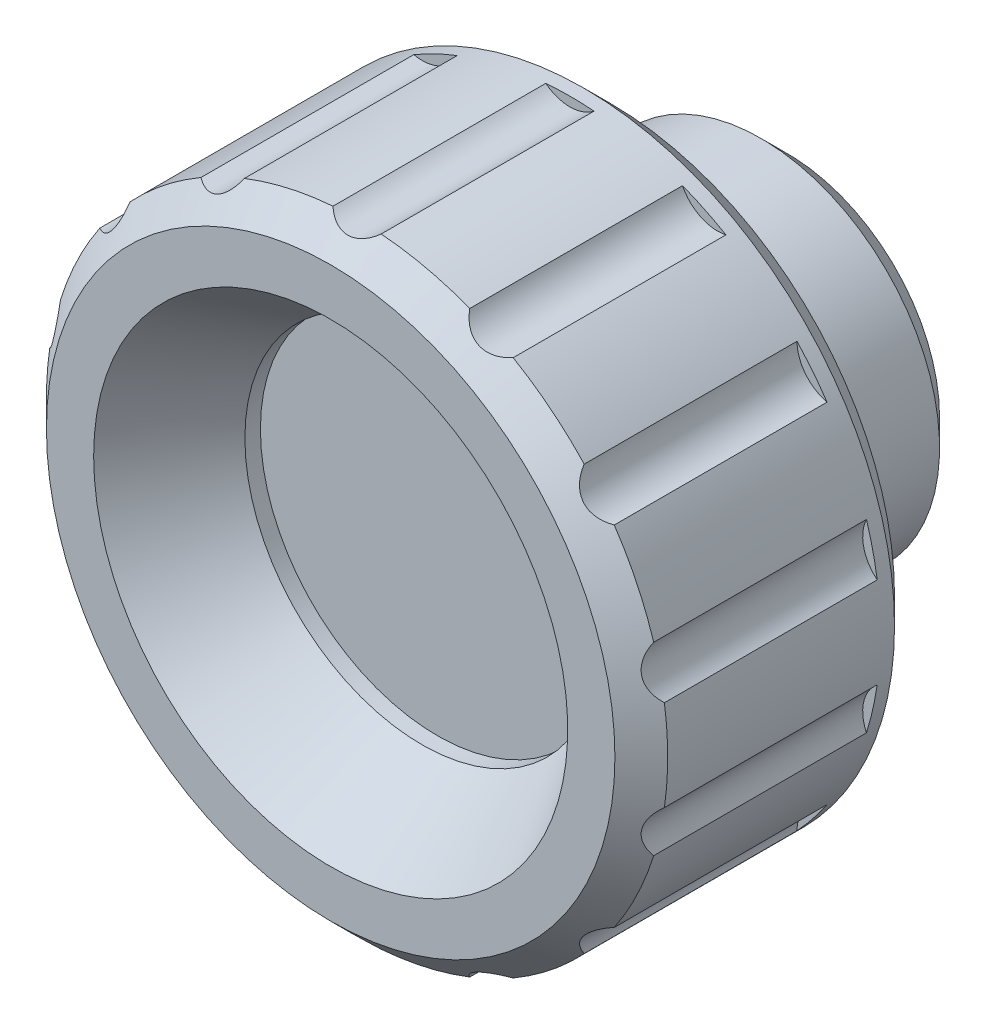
ISO-10303-21;
HEADER;
FILE_DESCRIPTION(('STEP AP214'),'2;1');
FILE_NAME('part.step','',(''),(''),'','','');
FILE_SCHEMA(('AUTOMOTIVE_DESIGN { 1 0 10303 214 1 1 1 1 }'));
ENDSEC;
DATA;
#1=APPLICATION_CONTEXT('core data for automotive mechanical design processes');
#2=APPLICATION_PROTOCOL_DEFINITION('international standard','automotive_design',2000,#1);
#3=PRODUCT_CONTEXT('',#1,'mechanical');
#4=PRODUCT('Part','Part','',(#3));
#5=PRODUCT_RELATED_PRODUCT_CATEGORY('part','',(#4));
#6=PRODUCT_DEFINITION_FORMATION('','',#4);
#7=PRODUCT_DEFINITION_CONTEXT('part definition',#1,'design');
#8=PRODUCT_DEFINITION('design','',#6,#7);
#9=PRODUCT_DEFINITION_SHAPE('','',#8);
#10=(LENGTH_UNIT() NAMED_UNIT(*) SI_UNIT(.MILLI.,.METRE.));
#11=(NAMED_UNIT(*) PLANE_ANGLE_UNIT() SI_UNIT($,.RADIAN.));
#12=(NAMED_UNIT(*) SI_UNIT($,.STERADIAN.) SOLID_ANGLE_UNIT());
#13=UNCERTAINTY_MEASURE_WITH_UNIT(LENGTH_MEASURE(1.E-05),#10,'distance_accuracy_value','');
#14=(GEOMETRIC_REPRESENTATION_CONTEXT(3) GLOBAL_UNCERTAINTY_ASSIGNED_CONTEXT((#13)) GLOBAL_UNIT_ASSIGNED_CONTEXT((#10,
#11,#12)) REPRESENTATION_CONTEXT('',''));
#15=CARTESIAN_POINT('',(0.,0.,0.));
#16=DIRECTION('',(0.,0.,1.));
#17=DIRECTION('',(1.,0.,0.));
#18=AXIS2_PLACEMENT_3D('',#15,#16,#17);
#19=CARTESIAN_POINT('',(0.,0.,0.));
#20=DIRECTION('',(0.,0.,-1.));
#21=DIRECTION('',(0.,1.,0.));
#22=AXIS2_PLACEMENT_3D('',#19,#20,#21);
#23=CYLINDRICAL_SURFACE('',#22,10.);
#24=CARTESIAN_POINT('',(0.,0.,14.15));
#25=DIRECTION('',(0.,0.,-1.));
#26=DIRECTION('',(-1.,0.,0.));
#27=AXIS2_PLACEMENT_3D('',#24,#25,#26);
#28=CIRCLE('',#27,10.);
#29=CARTESIAN_POINT('',(-8.27844244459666,-5.60958025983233,14.15));
#30=VERTEX_POINT('',#29);
#31=CARTESIAN_POINT('',(-9.54727089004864,-2.97483084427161,14.15));
#32=VERTEX_POINT('',#31);
#33=EDGE_CURVE('E226',#30,#32,#28,.T.);
#34=ORIENTED_EDGE('',*,*,#33,.T.);
#35=DIRECTION('',(0.,0.,1.));
#36=VECTOR('',#35,1.);
#37=CARTESIAN_POINT('',(-9.54727089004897,-2.97483084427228,7.3));
#38=LINE('',#37,#36);
#39=CARTESIAN_POINT('',(-9.54727089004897,-2.97483084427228,7.3));
#40=VERTEX_POINT('',#39);
#41=EDGE_CURVE('E234',#40,#32,#38,.T.);
#42=ORIENTED_EDGE('',*,*,#41,.F.);
#43=CARTESIAN_POINT('',(0.,0.,7.3));
#44=DIRECTION('',(0.,0.,1.));
#45=DIRECTION('',(0.,-1.,0.));
#46=AXIS2_PLACEMENT_3D('',#43,#44,#45);
#47=CIRCLE('',#46,10.);
#48=CARTESIAN_POINT('',(-9.89252457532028,-1.46217561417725,7.3));
#49=VERTEX_POINT('',#48);
#50=EDGE_CURVE('E412',#40,#49,#47,.F.);
#51=ORIENTED_EDGE('',*,*,#50,.T.);
#52=DIRECTION('',(0.,0.,1.));
#53=VECTOR('',#52,1.);
#54=CARTESIAN_POINT('',(-9.89252457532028,-1.46217561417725,7.3));
#55=LINE('',#54,#53);
#56=CARTESIAN_POINT('',(-9.89252457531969,-1.46217561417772,14.15));
#57=VERTEX_POINT('',#56);
#58=EDGE_CURVE('E225',#49,#57,#55,.T.);
#59=ORIENTED_EDGE('',*,*,#58,.T.);
#60=CARTESIAN_POINT('',(-9.8925245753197,1.46217561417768,14.15));
#61=VERTEX_POINT('',#60);
#62=EDGE_CURVE('E207',#57,#61,#28,.T.);
#63=ORIENTED_EDGE('',*,*,#62,.T.);
#64=DIRECTION('',(0.,0.,1.));
#65=VECTOR('',#64,1.);
#66=CARTESIAN_POINT('',(-9.89252457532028,1.46217561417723,7.3));
#67=LINE('',#66,#65);
#68=CARTESIAN_POINT('',(-9.89252457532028,1.46217561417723,7.3));
#69=VERTEX_POINT('',#68);
#70=EDGE_CURVE('E223',#69,#61,#67,.T.);
#71=ORIENTED_EDGE('',*,*,#70,.F.);
#72=CARTESIAN_POINT('',(-9.54727089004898,2.97483084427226,7.3));
#73=VERTEX_POINT('',#72);
#74=EDGE_CURVE('E918',#69,#73,#47,.F.);
#75=ORIENTED_EDGE('',*,*,#74,.T.);
#76=DIRECTION('',(0.,0.,1.));
#77=VECTOR('',#76,1.);
#78=CARTESIAN_POINT('',(-9.54727089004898,2.97483084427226,7.3));
#79=LINE('',#78,#77);
#80=CARTESIAN_POINT('',(-9.54727089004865,2.97483084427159,14.15));
#81=VERTEX_POINT('',#80);
#82=EDGE_CURVE('E232',#73,#81,#79,.T.);
#83=ORIENTED_EDGE('',*,*,#82,.T.);
#84=CARTESIAN_POINT('',(-8.27844244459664,5.60958025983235,14.15));
#85=VERTEX_POINT('',#84);
#86=EDGE_CURVE('E210',#81,#85,#28,.T.);
#87=ORIENTED_EDGE('',*,*,#86,.T.);
#88=DIRECTION('',(0.,0.,1.));
#89=VECTOR('',#88,1.);
#90=CARTESIAN_POINT('',(-8.27844244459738,5.60958025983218,7.3));
#91=LINE('',#90,#89);
#92=CARTESIAN_POINT('',(-8.27844244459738,5.60958025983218,7.3));
#93=VERTEX_POINT('',#92);
#94=EDGE_CURVE('E236',#93,#85,#91,.T.);
#95=ORIENTED_EDGE('',*,*,#94,.F.);
#96=CARTESIAN_POINT('',(-7.31106311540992,6.82263557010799,7.3));
#97=VERTEX_POINT('',#96);
#98=EDGE_CURVE('E919',#93,#97,#47,.F.);
#99=ORIENTED_EDGE('',*,*,#98,.T.);
#100=DIRECTION('',(0.,0.,1.));
#101=VECTOR('',#100,1.);
#102=CARTESIAN_POINT('',(-7.31106311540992,6.82263557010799,7.3));
#103=LINE('',#102,#101);
#104=CARTESIAN_POINT('',(-7.31106311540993,6.82263557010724,14.15));
#105=VERTEX_POINT('',#104);
#106=EDGE_CURVE('E242',#97,#105,#103,.T.);
#107=ORIENTED_EDGE('',*,*,#106,.T.);
#108=CARTESIAN_POINT('',(-5.02471325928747,8.64593873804,14.15));
#109=VERTEX_POINT('',#108);
#110=EDGE_CURVE('E888',#105,#109,#28,.T.);
#111=ORIENTED_EDGE('',*,*,#110,.T.);
#112=DIRECTION('',(0.,0.,1.));
#113=VECTOR('',#112,1.);
#114=CARTESIAN_POINT('',(-5.02471325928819,8.64593873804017,7.3));
#115=LINE('',#114,#113);
#116=CARTESIAN_POINT('',(-5.02471325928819,8.64593873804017,7.3));
#117=VERTEX_POINT('',#116);
#118=EDGE_CURVE('E245',#117,#109,#115,.T.);
#119=ORIENTED_EDGE('',*,*,#118,.F.);
#120=CARTESIAN_POINT('',(-3.62680962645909,9.3191336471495,7.3));
#121=VERTEX_POINT('',#120);
#122=EDGE_CURVE('E272',#117,#121,#47,.F.);
#123=ORIENTED_EDGE('',*,*,#122,.T.);
#124=DIRECTION('',(0.,0.,1.));
#125=VECTOR('',#124,1.);
#126=CARTESIAN_POINT('',(-3.62680962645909,9.3191336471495,7.3));
#127=LINE('',#126,#125);
#128=CARTESIAN_POINT('',(-3.62680962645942,9.31913364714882,14.15));
#129=VERTEX_POINT('',#128);
#130=EDGE_CURVE('E248',#121,#129,#127,.T.);
#131=ORIENTED_EDGE('',*,*,#130,.T.);
#132=CARTESIAN_POINT('',(-0.775777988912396,9.96986301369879,14.15));
#133=VERTEX_POINT('',#132);
#134=EDGE_CURVE('E883',#129,#133,#28,.T.);
#135=ORIENTED_EDGE('',*,*,#134,.T.);
#136=DIRECTION('',(0.,0.,1.));
#137=VECTOR('',#136,1.);
#138=CARTESIAN_POINT('',(-0.775777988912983,9.96986301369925,7.3));
#139=LINE('',#138,#137);
#140=CARTESIAN_POINT('',(-0.775777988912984,9.96986301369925,7.3));
#141=VERTEX_POINT('',#140);
#142=EDGE_CURVE('E251',#141,#133,#139,.T.);
#143=ORIENTED_EDGE('',*,*,#142,.F.);
#144=CARTESIAN_POINT('',(0.775777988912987,9.96986301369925,7.3));
#145=VERTEX_POINT('',#144);
#146=EDGE_CURVE('E41',#141,#145,#47,.F.);
#147=ORIENTED_EDGE('',*,*,#146,.T.);
#148=DIRECTION('',(0.,0.,1.));
#149=VECTOR('',#148,1.);
#150=CARTESIAN_POINT('',(0.775777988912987,9.96986301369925,7.3));
#151=LINE('',#150,#149);
#152=CARTESIAN_POINT('',(0.775777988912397,9.96986301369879,14.15));
#153=VERTEX_POINT('',#152);
#154=EDGE_CURVE('E254',#145,#153,#151,.T.);
#155=ORIENTED_EDGE('',*,*,#154,.T.);
#156=CARTESIAN_POINT('',(3.62680962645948,9.3191336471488,14.15));
#157=VERTEX_POINT('',#156);
#158=EDGE_CURVE('E886',#153,#157,#28,.T.);
#159=ORIENTED_EDGE('',*,*,#158,.T.);
#160=DIRECTION('',(0.,0.,1.));
#161=VECTOR('',#160,1.);
#162=CARTESIAN_POINT('',(3.62680962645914,9.31913364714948,7.3));
#163=LINE('',#162,#161);
#164=CARTESIAN_POINT('',(3.62680962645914,9.31913364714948,7.3));
#165=VERTEX_POINT('',#164);
#166=EDGE_CURVE('E262',#165,#157,#163,.T.);
#167=ORIENTED_EDGE('',*,*,#166,.F.);
#168=CARTESIAN_POINT('',(5.02471325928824,8.64593873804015,7.3));
#169=VERTEX_POINT('',#168);
#170=EDGE_CURVE('E273',#165,#169,#47,.F.);
#171=ORIENTED_EDGE('',*,*,#170,.T.);
#172=DIRECTION('',(0.,0.,1.));
#173=VECTOR('',#172,1.);
#174=CARTESIAN_POINT('',(5.02471325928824,8.64593873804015,7.3));
#175=LINE('',#174,#173);
#176=CARTESIAN_POINT('',(5.02471325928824,8.64593873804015,14.15));
#177=VERTEX_POINT('',#176);
#178=EDGE_CURVE('E357',#169,#177,#175,.T.);
#179=ORIENTED_EDGE('',*,*,#178,.T.);
#180=CARTESIAN_POINT('',(7.31106311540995,6.82263557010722,14.15));
#181=VERTEX_POINT('',#180);
#182=EDGE_CURVE('E34',#177,#181,#28,.T.);
#183=ORIENTED_EDGE('',*,*,#182,.T.);
#184=DIRECTION('',(0.,0.,1.));
#185=VECTOR('',#184,1.);
#186=CARTESIAN_POINT('',(7.31106311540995,6.82263557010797,7.3));
#187=LINE('',#186,#185);
#188=CARTESIAN_POINT('',(7.31106311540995,6.82263557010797,7.3));
#189=VERTEX_POINT('',#188);
#190=EDGE_CURVE('E360',#189,#181,#187,.T.);
#191=ORIENTED_EDGE('',*,*,#190,.F.);
#192=CARTESIAN_POINT('',(8.27844244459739,5.60958025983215,7.3));
#193=VERTEX_POINT('',#192);
#194=EDGE_CURVE('E935',#189,#193,#47,.F.);
#195=ORIENTED_EDGE('',*,*,#194,.T.);
#196=DIRECTION('',(0.,0.,1.));
#197=VECTOR('',#196,1.);
#198=CARTESIAN_POINT('',(8.27844244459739,5.60958025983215,7.3));
#199=LINE('',#198,#197);
#200=CARTESIAN_POINT('',(8.27844244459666,5.60958025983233,14.15));
#201=VERTEX_POINT('',#200);
#202=EDGE_CURVE('E363',#193,#201,#199,.T.);
#203=ORIENTED_EDGE('',*,*,#202,.T.);
#204=CARTESIAN_POINT('',(9.54727089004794,2.97483084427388,14.15));
#205=VERTEX_POINT('',#204);
#206=EDGE_CURVE('E889',#201,#205,#28,.T.);
#207=ORIENTED_EDGE('',*,*,#206,.T.);
#208=DIRECTION('',(0.,0.,1.));
#209=VECTOR('',#208,1.);
#210=CARTESIAN_POINT('',(9.54727089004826,2.97483084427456,7.3));
#211=LINE('',#210,#209);
#212=CARTESIAN_POINT('',(9.54727089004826,2.97483084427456,7.3));
#213=VERTEX_POINT('',#212);
#214=EDGE_CURVE('E366',#213,#205,#211,.T.);
#215=ORIENTED_EDGE('',*,*,#214,.F.);
#216=CARTESIAN_POINT('',(9.89252457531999,1.46217561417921,7.3));
#217=VERTEX_POINT('',#216);
#218=EDGE_CURVE('E934',#213,#217,#47,.F.);
#219=ORIENTED_EDGE('',*,*,#218,.T.);
#220=DIRECTION('',(0.,0.,1.));
#221=VECTOR('',#220,1.);
#222=CARTESIAN_POINT('',(9.89252457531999,1.46217561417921,7.3));
#223=LINE('',#222,#221);
#224=CARTESIAN_POINT('',(9.8925245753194,1.46217561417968,14.15));
#225=VERTEX_POINT('',#224);
#226=EDGE_CURVE('E369',#217,#225,#223,.T.);
#227=ORIENTED_EDGE('',*,*,#226,.T.);
#228=CARTESIAN_POINT('',(9.89252457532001,-1.46217561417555,14.15));
#229=VERTEX_POINT('',#228);
#230=EDGE_CURVE('E892',#225,#229,#28,.T.);
#231=ORIENTED_EDGE('',*,*,#230,.T.);
#232=DIRECTION('',(0.,0.,1.));
#233=VECTOR('',#232,1.);
#234=CARTESIAN_POINT('',(9.8925245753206,-1.46217561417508,7.3));
#235=LINE('',#234,#233);
#236=CARTESIAN_POINT('',(9.8925245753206,-1.46217561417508,7.3));
#237=VERTEX_POINT('',#236);
#238=EDGE_CURVE('E372',#237,#229,#235,.T.);
#239=ORIENTED_EDGE('',*,*,#238,.F.);
#240=CARTESIAN_POINT('',(9.54727089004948,-2.97483084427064,7.3));
#241=VERTEX_POINT('',#240);
#242=EDGE_CURVE('E936',#237,#241,#47,.F.);
#243=ORIENTED_EDGE('',*,*,#242,.T.);
#244=DIRECTION('',(0.,0.,1.));
#245=VECTOR('',#244,1.);
#246=CARTESIAN_POINT('',(9.54727089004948,-2.97483084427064,7.3));
#247=LINE('',#246,#245);
#248=CARTESIAN_POINT('',(9.54727089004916,-2.97483084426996,14.15));
#249=VERTEX_POINT('',#248);
#250=EDGE_CURVE('E375',#241,#249,#247,.T.);
#251=ORIENTED_EDGE('',*,*,#250,.T.);
#252=CARTESIAN_POINT('',(8.27844244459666,-5.60958025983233,14.15));
#253=VERTEX_POINT('',#252);
#254=EDGE_CURVE('E895',#249,#253,#28,.T.);
#255=ORIENTED_EDGE('',*,*,#254,.T.);
#256=DIRECTION('',(0.,0.,1.));
#257=VECTOR('',#256,1.);
#258=CARTESIAN_POINT('',(8.27844244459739,-5.60958025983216,7.3));
#259=LINE('',#258,#257);
#260=CARTESIAN_POINT('',(8.27844244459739,-5.60958025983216,7.3));
#261=VERTEX_POINT('',#260);
#262=EDGE_CURVE('E378',#261,#253,#259,.T.);
#263=ORIENTED_EDGE('',*,*,#262,.F.);
#264=CARTESIAN_POINT('',(7.31106311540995,-6.82263557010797,7.3));
#265=VERTEX_POINT('',#264);
#266=EDGE_CURVE('E939',#261,#265,#47,.F.);
#267=ORIENTED_EDGE('',*,*,#266,.T.);
#268=DIRECTION('',(0.,0.,1.));
#269=VECTOR('',#268,1.);
#270=CARTESIAN_POINT('',(7.31106311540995,-6.82263557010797,7.3));
#271=LINE('',#270,#269);
#272=CARTESIAN_POINT('',(7.31106311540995,-6.82263557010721,14.15));
#273=VERTEX_POINT('',#272);
#274=EDGE_CURVE('E381',#265,#273,#271,.T.);
#275=ORIENTED_EDGE('',*,*,#274,.T.);
#276=CARTESIAN_POINT('',(5.02471325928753,-8.64593873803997,14.15));
#277=VERTEX_POINT('',#276);
#278=EDGE_CURVE('E898',#273,#277,#28,.T.);
#279=ORIENTED_EDGE('',*,*,#278,.T.);
#280=DIRECTION('',(0.,0.,1.));
#281=VECTOR('',#280,1.);
#282=CARTESIAN_POINT('',(5.02471325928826,-8.64593873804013,7.3));
#283=LINE('',#282,#281);
#284=CARTESIAN_POINT('',(5.02471325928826,-8.64593873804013,7.3));
#285=VERTEX_POINT('',#284);
#286=EDGE_CURVE('E384',#285,#277,#283,.T.);
#287=ORIENTED_EDGE('',*,*,#286,.F.);
#288=CARTESIAN_POINT('',(3.62680962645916,-9.31913364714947,7.3));
#289=VERTEX_POINT('',#288);
#290=EDGE_CURVE('E916',#285,#289,#47,.F.);
#291=ORIENTED_EDGE('',*,*,#290,.T.);
#292=DIRECTION('',(0.,0.,1.));
#293=VECTOR('',#292,1.);
#294=CARTESIAN_POINT('',(3.62680962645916,-9.31913364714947,7.3));
#295=LINE('',#294,#293);
#296=CARTESIAN_POINT('',(3.62680962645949,-9.31913364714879,14.15));
#297=VERTEX_POINT('',#296);
#298=EDGE_CURVE('E387',#289,#297,#295,.T.);
#299=ORIENTED_EDGE('',*,*,#298,.T.);
#300=CARTESIAN_POINT('',(0.775777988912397,-9.96986301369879,14.15));
#301=VERTEX_POINT('',#300);
#302=EDGE_CURVE('E901',#297,#301,#28,.T.);
#303=ORIENTED_EDGE('',*,*,#302,.T.);
#304=DIRECTION('',(0.,0.,1.));
#305=VECTOR('',#304,1.);
#306=CARTESIAN_POINT('',(0.775777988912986,-9.96986301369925,7.3));
#307=LINE('',#306,#305);
#308=CARTESIAN_POINT('',(0.775777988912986,-9.96986301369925,7.3));
#309=VERTEX_POINT('',#308);
#310=EDGE_CURVE('E390',#309,#301,#307,.T.);
#311=ORIENTED_EDGE('',*,*,#310,.F.);
#312=CARTESIAN_POINT('',(-0.775777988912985,-9.96986301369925,7.3));
#313=VERTEX_POINT('',#312);
#314=EDGE_CURVE('E914',#309,#313,#47,.F.);
#315=ORIENTED_EDGE('',*,*,#314,.T.);
#316=DIRECTION('',(0.,0.,1.));
#317=VECTOR('',#316,1.);
#318=CARTESIAN_POINT('',(-0.775777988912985,-9.96986301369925,7.3));
#319=LINE('',#318,#317);
#320=CARTESIAN_POINT('',(-0.775777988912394,-9.96986301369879,14.15));
#321=VERTEX_POINT('',#320);
#322=EDGE_CURVE('E393',#313,#321,#319,.T.);
#323=ORIENTED_EDGE('',*,*,#322,.T.);
#324=CARTESIAN_POINT('',(-3.62680962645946,-9.3191336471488,14.15));
#325=VERTEX_POINT('',#324);
#326=EDGE_CURVE('E417',#321,#325,#28,.T.);
#327=ORIENTED_EDGE('',*,*,#326,.T.);
#328=DIRECTION('',(0.,0.,1.));
#329=VECTOR('',#328,1.);
#330=CARTESIAN_POINT('',(-3.62680962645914,-9.31913364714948,7.3));
#331=LINE('',#330,#329);
#332=CARTESIAN_POINT('',(-3.62680962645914,-9.31913364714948,7.3));
#333=VERTEX_POINT('',#332);
#334=EDGE_CURVE('E396',#333,#325,#331,.T.);
#335=ORIENTED_EDGE('',*,*,#334,.F.);
#336=CARTESIAN_POINT('',(-5.02471325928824,-8.64593873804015,7.3));
#337=VERTEX_POINT('',#336);
#338=EDGE_CURVE('E913',#333,#337,#47,.F.);
#339=ORIENTED_EDGE('',*,*,#338,.T.);
#340=DIRECTION('',(0.,0.,1.));
#341=VECTOR('',#340,1.);
#342=CARTESIAN_POINT('',(-5.02471325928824,-8.64593873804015,7.3));
#343=LINE('',#342,#341);
#344=CARTESIAN_POINT('',(-5.02471325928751,-8.64593873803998,14.15));
#345=VERTEX_POINT('',#344);
#346=EDGE_CURVE('E399',#337,#345,#343,.T.);
#347=ORIENTED_EDGE('',*,*,#346,.T.);
#348=CARTESIAN_POINT('',(-7.31106311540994,-6.82263557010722,14.15));
#349=VERTEX_POINT('',#348);
#350=EDGE_CURVE('E415',#345,#349,#28,.T.);
#351=ORIENTED_EDGE('',*,*,#350,.T.);
#352=DIRECTION('',(0.,0.,1.));
#353=VECTOR('',#352,1.);
#354=CARTESIAN_POINT('',(-7.31106311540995,-6.82263557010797,7.3));
#355=LINE('',#354,#353);
#356=CARTESIAN_POINT('',(-7.31106311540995,-6.82263557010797,7.3));
#357=VERTEX_POINT('',#356);
#358=EDGE_CURVE('E402',#357,#349,#355,.T.);
#359=ORIENTED_EDGE('',*,*,#358,.F.);
#360=CARTESIAN_POINT('',(-8.27844244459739,-5.60958025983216,7.3));
#361=VERTEX_POINT('',#360);
#362=EDGE_CURVE('E915',#357,#361,#47,.F.);
#363=ORIENTED_EDGE('',*,*,#362,.T.);
#364=DIRECTION('',(0.,0.,1.));
#365=VECTOR('',#364,1.);
#366=CARTESIAN_POINT('',(-8.27844244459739,-5.60958025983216,7.3));
#367=LINE('',#366,#365);
#368=EDGE_CURVE('E405',#361,#30,#367,.T.);
#369=ORIENTED_EDGE('',*,*,#368,.T.);
#370=EDGE_LOOP('',(#34,#42,#51,#59,#63,#71,#75,#83,#87,#95,#99,#107,#111,#119,#123,#131,#135,
#143,#147,#155,#159,#167,#171,#179,#183,#191,#195,#203,#207,#215,#219,#227,#231,#239,#243,#251,
#255,#263,#267,#275,#279,#287,#291,#299,#303,#311,#315,#323,#327,#335,#339,#347,#351,#359,#363,#369));
#371=FACE_BOUND('',#370,.T.);
#372=CARTESIAN_POINT('',(0.,0.,6.85));
#373=DIRECTION('',(0.,0.,-1.));
#374=DIRECTION('',(0.,1.,0.));
#375=AXIS2_PLACEMENT_3D('',#372,#373,#374);
#376=CIRCLE('',#375,10.);
#377=CARTESIAN_POINT('',(0.,10.,6.85));
#378=VERTEX_POINT('',#377);
#379=EDGE_CURVE('E258',#378,#378,#376,.T.);
#380=ORIENTED_EDGE('',*,*,#379,.F.);
#381=EDGE_LOOP('',(#380));
#382=FACE_BOUND('',#381,.T.);
#383=ADVANCED_FACE('F14',(#371,#382),#23,.T.);
#384=CARTESIAN_POINT('',(9.15,0.,6.));
#385=DIRECTION('',(0.,0.,-1.));
#386=DIRECTION('',(0.,1.,0.));
#387=AXIS2_PLACEMENT_3D('',#384,#385,#386);
#388=PLANE('',#387);
#389=CARTESIAN_POINT('',(0.,0.,6.));
#390=DIRECTION('',(0.,0.,-1.));
#391=DIRECTION('',(0.,1.,0.));
#392=AXIS2_PLACEMENT_3D('',#389,#390,#391);
#393=CIRCLE('',#392,9.15);
#394=CARTESIAN_POINT('',(0.,9.15,6.));
#395=VERTEX_POINT('',#394);
#396=EDGE_CURVE('E261',#395,#395,#393,.T.);
#397=ORIENTED_EDGE('',*,*,#396,.T.);
#398=EDGE_LOOP('',(#397));
#399=FACE_BOUND('',#398,.T.);
#400=CARTESIAN_POINT('',(0.,0.,6.));
#401=DIRECTION('',(0.,0.,-1.));
#402=DIRECTION('',(-1.,0.,0.));
#403=AXIS2_PLACEMENT_3D('',#400,#401,#402);
#404=CIRCLE('',#403,5.75);
#405=CARTESIAN_POINT('',(-5.75,0.,6.));
#406=VERTEX_POINT('',#405);
#407=EDGE_CURVE('E303',#406,#406,#404,.T.);
#408=ORIENTED_EDGE('',*,*,#407,.F.);
#409=EDGE_LOOP('',(#408));
#410=FACE_BOUND('',#409,.T.);
#411=ADVANCED_FACE('F552',(#399,#410),#388,.T.);
#412=CARTESIAN_POINT('',(0.,0.,6.));
#413=DIRECTION('',(0.,0.,1.));
#414=DIRECTION('',(0.,-1.,0.));
#415=AXIS2_PLACEMENT_3D('',#412,#413,#414);
#416=CONICAL_SURFACE('',#415,9.15,0.785398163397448);
#417=ORIENTED_EDGE('',*,*,#379,.T.);
#418=EDGE_LOOP('',(#417));
#419=FACE_BOUND('',#418,.T.);
#420=ORIENTED_EDGE('',*,*,#396,.F.);
#421=EDGE_LOOP('',(#420));
#422=FACE_BOUND('',#421,.T.);
#423=ADVANCED_FACE('F540',(#419,#422),#416,.T.);
#424=CARTESIAN_POINT('',(0.,10.9500000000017,7.3));
#425=DIRECTION('',(0.,0.,1.));
#426=DIRECTION('',(0.,-1.,0.));
#427=AXIS2_PLACEMENT_3D('',#424,#425,#426);
#428=CYLINDRICAL_SURFACE('',#427,1.25);
#429=CARTESIAN_POINT('',(0.775977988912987,9.97002134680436,14.1498266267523));
#430=CARTESIAN_POINT('',(0.734586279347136,9.93724261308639,14.1857107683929));
#431=CARTESIAN_POINT('',(0.68995529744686,9.90618033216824,14.2199249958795));
#432=CARTESIAN_POINT('',(0.593942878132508,9.84868428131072,14.2835331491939));
#433=CARTESIAN_POINT('',(0.542499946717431,9.82229852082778,14.3128768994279));
#434=CARTESIAN_POINT('',(0.443151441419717,9.78017982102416,14.3598826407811));
#435=CARTESIAN_POINT('',(0.396256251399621,9.76338583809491,14.3786950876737));
#436=CARTESIAN_POINT('',(0.299067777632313,9.73525526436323,14.4102700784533));
#437=CARTESIAN_POINT('',(0.248787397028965,9.7238991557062,14.4230542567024));
#438=CARTESIAN_POINT('',(0.145474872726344,9.70738511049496,14.4416620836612));
#439=CARTESIAN_POINT('',(0.0924231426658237,9.70228010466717,14.4474262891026));
#440=CARTESIAN_POINT('',(-0.0142000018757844,9.69894396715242,14.4511919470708));
#441=CARTESIAN_POINT('',(-0.0677715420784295,9.70071454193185,14.4491914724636));
#442=CARTESIAN_POINT('',(-0.167200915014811,9.71034496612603,14.4383278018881));
#443=CARTESIAN_POINT('',(-0.213227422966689,9.71746747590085,14.4302956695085));
#444=CARTESIAN_POINT('',(-0.30302476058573,9.7364164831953,14.4089716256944));
#445=CARTESIAN_POINT('',(-0.346794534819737,9.74824515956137,14.3956772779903));
#446=CARTESIAN_POINT('',(-0.445997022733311,9.78073865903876,14.3592589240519));
#447=CARTESIAN_POINT('',(-0.500224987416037,9.80304471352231,14.3343253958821));
#448=CARTESIAN_POINT('',(-0.602533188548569,9.8533143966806,14.2784064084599));
#449=CARTESIAN_POINT('',(-0.650605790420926,9.88128494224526,14.2474135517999));
#450=CARTESIAN_POINT('',(-0.723578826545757,9.93016500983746,14.1935419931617));
#451=CARTESIAN_POINT('',(-0.750378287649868,9.94975642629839,14.1720143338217));
#452=CARTESIAN_POINT('',(-0.775977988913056,9.97002134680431,14.1498266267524));
#453=B_SPLINE_CURVE_WITH_KNOTS('',3,(#429,#430,#431,#432,#433,#434,#435,#436,#437,#438,#439,
#440,#441,#442,#443,#444,#445,#446,#447,#448,#449,#450,#451,#452),.UNSPECIFIED.,.F.,.F.,(4,2,2,
2,2,2,2,2,2,2,2,4),(0.,0.191836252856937,0.385540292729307,0.544632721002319,0.703149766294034,
0.86299996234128,1.022889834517,1.16405643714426,1.3052884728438,1.49538818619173,
1.68572144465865,1.80423553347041),.UNSPECIFIED.);
#454=EDGE_CURVE('E304',#153,#133,#453,.T.);
#455=ORIENTED_EDGE('',*,*,#454,.F.);
#456=ORIENTED_EDGE('',*,*,#154,.F.);
#457=CARTESIAN_POINT('',(0.,10.9500000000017,7.3));
#458=DIRECTION('',(0.,0.,-1.));
#459=DIRECTION('',(0.,-1.,0.));
#460=AXIS2_PLACEMENT_3D('',#457,#458,#459);
#461=CIRCLE('',#460,1.25);
#462=EDGE_CURVE('E307',#145,#141,#461,.T.);
#463=ORIENTED_EDGE('',*,*,#462,.T.);
#464=ORIENTED_EDGE('',*,*,#142,.T.);
#465=EDGE_LOOP('',(#455,#456,#463,#464));
#466=FACE_BOUND('',#465,.T.);
#467=ADVANCED_FACE('F536',(#466),#428,.F.);
#468=CARTESIAN_POINT('',(0.,0.,7.3));
#469=DIRECTION('',(0.,0.,1.));
#470=DIRECTION('',(0.,-1.,0.));
#471=AXIS2_PLACEMENT_3D('',#468,#469,#470);
#472=PLANE('',#471);
#473=ORIENTED_EDGE('',*,*,#462,.F.);
#474=ORIENTED_EDGE('',*,*,#146,.F.);
#475=EDGE_LOOP('',(#473,#474));
#476=FACE_BOUND('',#475,.T.);
#477=ADVANCED_FACE('F532',(#476),#472,.T.);
#478=CARTESIAN_POINT('',(-4.75102694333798,9.86560910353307,7.3));
#479=DIRECTION('',(0.,0.,1.));
#480=DIRECTION('',(0.,-1.,0.));
#481=AXIS2_PLACEMENT_3D('',#478,#479,#480);
#482=CYLINDRICAL_SURFACE('',#481,1.25);
#483=CARTESIAN_POINT('',(-3.62668101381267,9.31939831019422,14.1498));
#484=CARTESIAN_POINT('',(-3.64975063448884,9.27190450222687,14.185686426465));
#485=CARTESIAN_POINT('',(-3.67648365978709,9.22455160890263,14.2199029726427));
#486=CARTESIAN_POINT('',(-3.73804039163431,9.13108688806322,14.2835157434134));
#487=CARTESIAN_POINT('',(-3.77294034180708,9.08499163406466,14.3128617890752));
#488=CARTESIAN_POINT('',(-3.84417515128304,9.00393496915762,14.3598710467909));
#489=CARTESIAN_POINT('',(-3.87913908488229,8.96845594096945,14.3786848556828));
#490=CARTESIAN_POINT('',(-3.95449665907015,8.90094031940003,14.4102625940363));
#491=CARTESIAN_POINT('',(-3.99487020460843,8.86889173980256,14.4230481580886));
#492=CARTESIAN_POINT('',(-4.08078621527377,8.80918487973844,14.4416586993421));
#493=CARTESIAN_POINT('',(-4.12636930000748,8.78156579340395,14.447424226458));
#494=CARTESIAN_POINT('',(-4.2209865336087,8.73229533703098,14.4511922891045));
#495=CARTESIAN_POINT('',(-4.27002153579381,8.71064544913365,14.4491928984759));
#496=CARTESIAN_POINT('',(-4.36378339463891,8.67617932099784,14.4383310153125));
#497=CARTESIAN_POINT('',(-4.4083422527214,8.66262548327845,14.4302997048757));
#498=CARTESIAN_POINT('',(-4.49746880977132,8.64073471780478,14.408977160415));
#499=CARTESIAN_POINT('',(-4.54203650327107,8.63240020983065,14.3956834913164));
#500=CARTESIAN_POINT('',(-4.64551253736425,8.61863194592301,14.35926702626));
#501=CARTESIAN_POINT('',(-4.70404762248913,8.61519944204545,14.3343348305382));
#502=CARTESIAN_POINT('',(-4.81803389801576,8.6160989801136,14.2784184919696));
#503=CARTESIAN_POINT('',(-4.87348120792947,8.62044057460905,14.2474269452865));
#504=CARTESIAN_POINT('',(-4.96045702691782,8.63281949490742,14.1935439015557));
#505=CARTESIAN_POINT('',(-4.99312357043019,8.63884697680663,14.1720023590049));
#506=CARTESIAN_POINT('',(-5.02500036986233,8.6460031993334,14.1498));
#507=B_SPLINE_CURVE_WITH_KNOTS('',3,(#483,#484,#485,#486,#487,#488,#489,#490,#491,#492,#493,
#494,#495,#496,#497,#498,#499,#500,#501,#502,#503,#504,#505,#506),.UNSPECIFIED.,.F.,.F.,(4,2,2,
2,2,2,2,2,2,2,2,4),(0.,0.191843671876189,0.385555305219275,0.544650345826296,0.70316998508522,
0.863022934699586,1.02291553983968,1.16408261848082,1.305315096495,1.49541104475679,
1.68574073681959,1.80433015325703),.UNSPECIFIED.);
#508=EDGE_CURVE('E309',#129,#109,#507,.T.);
#509=ORIENTED_EDGE('',*,*,#508,.F.);
#510=ORIENTED_EDGE('',*,*,#130,.F.);
#511=CARTESIAN_POINT('',(-4.75102694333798,9.86560910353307,7.3));
#512=DIRECTION('',(0.,0.,-1.));
#513=DIRECTION('',(0.,-1.,0.));
#514=AXIS2_PLACEMENT_3D('',#511,#512,#513);
#515=CIRCLE('',#514,1.25);
#516=EDGE_CURVE('E319',#121,#117,#515,.T.);
#517=ORIENTED_EDGE('',*,*,#516,.T.);
#518=ORIENTED_EDGE('',*,*,#118,.T.);
#519=EDGE_LOOP('',(#509,#510,#517,#518));
#520=FACE_BOUND('',#519,.T.);
#521=ADVANCED_FACE('F528',(#520),#482,.F.);
#522=ORIENTED_EDGE('',*,*,#516,.F.);
#523=ORIENTED_EDGE('',*,*,#122,.F.);
#524=EDGE_LOOP('',(#522,#523));
#525=FACE_BOUND('',#524,.T.);
#526=ADVANCED_FACE('F531',(#525),#472,.T.);
#527=CARTESIAN_POINT('',(-8.56105473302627,6.82721333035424,7.3));
#528=DIRECTION('',(0.,0.,1.));
#529=DIRECTION('',(0.,-1.,0.));
#530=AXIS2_PLACEMENT_3D('',#527,#528,#529);
#531=CYLINDRICAL_SURFACE('',#530,1.25);
#532=CARTESIAN_POINT('',(-7.31106207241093,6.82292982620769,14.1498));
#533=CARTESIAN_POINT('',(-7.31124029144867,6.77012985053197,14.185686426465));
#534=CARTESIAN_POINT('',(-7.31478026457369,6.7158673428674,14.2199029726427));
#535=CARTESIAN_POINT('',(-7.32968814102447,6.60495007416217,14.2835157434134));
#536=CARTESIAN_POINT('',(-7.34113192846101,6.54827716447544,14.3128617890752));
#537=CARTESIAN_POINT('',(-7.37014310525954,6.44434000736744,14.3598710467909));
#538=CARTESIAN_POINT('',(-7.38625074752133,6.39720422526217,14.3786848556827));
#539=CARTESIAN_POINT('',(-7.42485164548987,6.30367832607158,14.4102625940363));
#540=CARTESIAN_POINT('',(-7.44732159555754,6.25728612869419,14.4230481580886));
#541=CARTESIAN_POINT('',(-7.4988234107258,6.16621454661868,14.4416586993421));
#542=CARTESIAN_POINT('',(-7.52790887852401,6.1215528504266,14.447424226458));
#543=CARTESIAN_POINT('',(-7.59177841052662,6.03610882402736,14.4511922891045));
#544=CARTESIAN_POINT('',(-7.62656388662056,5.99532745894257,14.449192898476));
#545=CARTESIAN_POINT('',(-7.69608610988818,5.92359280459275,14.4383310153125));
#546=CARTESIAN_POINT('',(-7.73035146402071,5.89204785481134,14.4302997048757));
#547=CARTESIAN_POINT('',(-7.80115367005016,5.83365439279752,14.408977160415));
#548=CARTESIAN_POINT('',(-7.83769156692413,5.80680806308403,14.3956834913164));
#549=CARTESIAN_POINT('',(-7.92494642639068,5.74950671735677,14.35926702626));
#550=CARTESIAN_POINT('',(-7.97619540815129,5.72101671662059,14.3343348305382));
#551=CARTESIAN_POINT('',(-8.07928378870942,5.67237038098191,14.2784184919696));
#552=CARTESIAN_POINT('',(-8.13112383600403,5.65222433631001,14.2474269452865));
#553=CARTESIAN_POINT('',(-8.21485735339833,5.62563996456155,14.1935439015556));
#554=CARTESIAN_POINT('',(-8.24690411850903,5.61689705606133,14.1720023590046));
#555=CARTESIAN_POINT('',(-8.27872909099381,5.60951376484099,14.1497999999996));
#556=B_SPLINE_CURVE_WITH_KNOTS('',3,(#532,#533,#534,#535,#536,#537,#538,#539,#540,#541,#542,
#543,#544,#545,#546,#547,#548,#549,#550,#551,#552,#553,#554,#555),.UNSPECIFIED.,.F.,.F.,(4,2,2,
2,2,2,2,2,2,2,2,4),(0.,0.191843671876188,0.385555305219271,0.544650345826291,0.703169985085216,
0.863022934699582,1.02291553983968,1.16408261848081,1.30531509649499,1.49541104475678,
1.68574073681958,1.80433015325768),.UNSPECIFIED.);
#557=EDGE_CURVE('E214',#105,#85,#556,.T.);
#558=ORIENTED_EDGE('',*,*,#557,.F.);
#559=ORIENTED_EDGE('',*,*,#106,.F.);
#560=CARTESIAN_POINT('',(-8.56105473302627,6.82721333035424,7.3));
#561=DIRECTION('',(0.,0.,-1.));
#562=DIRECTION('',(0.,-1.,0.));
#563=AXIS2_PLACEMENT_3D('',#560,#561,#562);
#564=CIRCLE('',#563,1.25);
#565=EDGE_CURVE('E322',#97,#93,#564,.T.);
#566=ORIENTED_EDGE('',*,*,#565,.T.);
#567=ORIENTED_EDGE('',*,*,#94,.T.);
#568=EDGE_LOOP('',(#558,#559,#566,#567));
#569=FACE_BOUND('',#568,.T.);
#570=ADVANCED_FACE('F534',(#569),#531,.F.);
#571=ORIENTED_EDGE('',*,*,#565,.F.);
#572=ORIENTED_EDGE('',*,*,#98,.F.);
#573=EDGE_LOOP('',(#571,#572));
#574=FACE_BOUND('',#573,.T.);
#575=ADVANCED_FACE('F859',(#574),#472,.T.);
#576=CARTESIAN_POINT('',(-10.6754606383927,2.43660422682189,7.3));
#577=DIRECTION('',(0.,0.,1.));
#578=DIRECTION('',(0.,-1.,0.));
#579=AXIS2_PLACEMENT_3D('',#576,#577,#578);
#580=CYLINDRICAL_SURFACE('',#579,1.25);
#581=CARTESIAN_POINT('',(-9.54736632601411,2.97503084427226,14.1498493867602));
#582=CARTESIAN_POINT('',(-9.52462174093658,2.9273834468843,14.1857315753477));
#583=CARTESIAN_POINT('',(-9.50427134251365,2.87696010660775,14.2199438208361));
#584=CARTESIAN_POINT('',(-9.46958497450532,2.77056257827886,14.2835480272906));
#585=CARTESIAN_POINT('',(-9.45530948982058,2.71453912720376,14.3128898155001));
#586=CARTESIAN_POINT('',(-9.43635639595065,2.60831065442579,14.3598925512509));
#587=CARTESIAN_POINT('',(-9.43041966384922,2.55885444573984,14.3787038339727));
#588=CARTESIAN_POINT('',(-9.42462285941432,2.45784375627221,14.4102764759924));
#589=CARTESIAN_POINT('',(-9.42474088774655,2.40629751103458,14.4230594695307));
#590=CARTESIAN_POINT('',(-9.43163191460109,2.30190179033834,14.4416649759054));
#591=CARTESIAN_POINT('',(-9.43846086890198,2.24904500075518,14.4474280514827));
#592=CARTESIAN_POINT('',(-9.45893571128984,2.14435457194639,14.4511916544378));
#593=CARTESIAN_POINT('',(-9.47258329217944,2.09252119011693,14.4491902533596));
#594=CARTESIAN_POINT('',(-9.50409843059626,1.99772918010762,14.4383250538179));
#595=CARTESIAN_POINT('',(-9.52128475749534,1.95444204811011,14.4302922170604));
#596=CARTESIAN_POINT('',(-9.55974139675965,1.8711137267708,14.4089668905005));
#597=CARTESIAN_POINT('',(-9.58101359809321,1.83107405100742,14.3956719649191));
#598=CARTESIAN_POINT('',(-9.63476844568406,1.7415896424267,14.3592520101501));
#599=CARTESIAN_POINT('',(-9.66858315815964,1.69368480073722,14.3343173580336));
#600=CARTESIAN_POINT('',(-9.74036028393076,1.60512785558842,14.2783961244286));
#601=CARTESIAN_POINT('',(-9.77832774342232,1.56448473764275,14.2474021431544));
#602=CARTESIAN_POINT('',(-9.84222639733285,1.50421436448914,14.1935250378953));
#603=CARTESIAN_POINT('',(-9.86729531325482,1.48244282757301,14.1719926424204));
#604=CARTESIAN_POINT('',(-9.89275398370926,1.46199133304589,14.1497999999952));
#605=B_SPLINE_CURVE_WITH_KNOTS('',3,(#581,#582,#583,#584,#585,#586,#587,#588,#589,#590,#591,
#592,#593,#594,#595,#596,#597,#598,#599,#600,#601,#602,#603,#604),.UNSPECIFIED.,.F.,.F.,(4,2,2,
2,2,2,2,2,2,2,2,4),(0.,0.191829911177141,0.385527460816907,0.54461765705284,0.703132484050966,
0.862980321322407,1.02286786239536,1.16403407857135,1.30526571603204,1.49536852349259,
1.68570495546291,1.80424243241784),.UNSPECIFIED.);
#606=EDGE_CURVE('E203',#81,#61,#605,.T.);
#607=ORIENTED_EDGE('',*,*,#606,.F.);
#608=ORIENTED_EDGE('',*,*,#82,.F.);
#609=CARTESIAN_POINT('',(-10.6754606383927,2.43660422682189,7.3));
#610=DIRECTION('',(0.,0.,-1.));
#611=DIRECTION('',(0.,-1.,0.));
#612=AXIS2_PLACEMENT_3D('',#609,#610,#611);
#613=CIRCLE('',#612,1.25);
#614=EDGE_CURVE('E231',#73,#69,#613,.T.);
#615=ORIENTED_EDGE('',*,*,#614,.T.);
#616=ORIENTED_EDGE('',*,*,#70,.T.);
#617=EDGE_LOOP('',(#607,#608,#615,#616));
#618=FACE_BOUND('',#617,.T.);
#619=ADVANCED_FACE('F229',(#618),#580,.F.);
#620=ORIENTED_EDGE('',*,*,#614,.F.);
#621=ORIENTED_EDGE('',*,*,#74,.F.);
#622=EDGE_LOOP('',(#620,#621));
#623=FACE_BOUND('',#622,.T.);
#624=ADVANCED_FACE('F856',(#623),#472,.T.);
#625=CARTESIAN_POINT('',(-10.6754606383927,-2.43660422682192,7.3));
#626=DIRECTION('',(0.,0.,1.));
#627=DIRECTION('',(0.,-1.,0.));
#628=AXIS2_PLACEMENT_3D('',#625,#626,#627);
#629=CYLINDRICAL_SURFACE('',#628,1.25);
#630=CARTESIAN_POINT('',(-9.89275398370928,-1.46199133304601,14.1497999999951));
#631=CARTESIAN_POINT('',(-9.85158441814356,-1.49505091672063,14.185686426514));
#632=CARTESIAN_POINT('',(-9.81136741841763,-1.53165069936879,14.2199029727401));
#633=CARTESIAN_POINT('',(-9.73394371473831,-1.61246193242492,14.283515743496));
#634=CARTESIAN_POINT('',(-9.69677013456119,-1.65674402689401,14.3128617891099));
#635=CARTESIAN_POINT('',(-9.63359696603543,-1.74422963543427,14.3598710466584));
#636=CARTESIAN_POINT('',(-9.60678767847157,-1.78621177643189,14.3786848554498));
#637=CARTESIAN_POINT('',(-9.55773345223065,-1.87470361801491,14.4102625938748));
#638=CARTESIAN_POINT('',(-9.53547235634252,-1.92119639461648,14.4230481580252));
#639=CARTESIAN_POINT('',(-9.49638058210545,-2.01824433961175,14.4416586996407));
#640=CARTESIAN_POINT('',(-9.47959715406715,-2.06883038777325,14.4474242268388));
#641=CARTESIAN_POINT('',(-9.45261632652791,-2.17203907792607,14.4511922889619));
#642=CARTESIAN_POINT('',(-9.44242056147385,-2.22466222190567,14.4491928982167));
#643=CARTESIAN_POINT('',(-9.42968254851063,-2.32374270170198,14.438331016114));
#644=CARTESIAN_POINT('',(-9.42638381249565,-2.37020038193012,14.4302997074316));
#645=CARTESIAN_POINT('',(-9.42487441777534,-2.46196350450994,14.4089771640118));
#646=CARTESIAN_POINT('',(-9.42666611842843,-2.50726840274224,14.3956834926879));
#647=CARTESIAN_POINT('',(-9.43626864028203,-2.61121384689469,14.3592670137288));
#648=CARTESIAN_POINT('',(-9.44594748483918,-2.66904517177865,14.3343348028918));
#649=CARTESIAN_POINT('',(-9.47218881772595,-2.77997341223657,14.2784184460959));
#650=CARTESIAN_POINT('',(-9.48875974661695,-2.83306442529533,14.2474269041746));
#651=CARTESIAN_POINT('',(-9.52017328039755,-2.9150816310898,14.1935592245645));
#652=CARTESIAN_POINT('',(-9.53330808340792,-2.94556603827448,14.1720342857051));
#653=CARTESIAN_POINT('',(-9.54736632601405,-2.97503084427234,14.1498493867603));
#654=B_SPLINE_CURVE_WITH_KNOTS('',3,(#630,#631,#632,#633,#634,#635,#636,#637,#638,#639,#640,
#641,#642,#643,#644,#645,#646,#647,#648,#649,#650,#651,#652,#653),.UNSPECIFIED.,.F.,.F.,(4,2,2,
2,2,2,2,2,2,2,2,4),(0.,0.191843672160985,0.385555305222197,0.544650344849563,0.703169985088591,
0.863022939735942,1.02291553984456,1.16408259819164,1.30531509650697,1.49541116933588,
1.68574073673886,1.80424237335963),.UNSPECIFIED.);
#655=EDGE_CURVE('E215',#57,#32,#654,.T.);
#656=ORIENTED_EDGE('',*,*,#655,.F.);
#657=ORIENTED_EDGE('',*,*,#58,.F.);
#658=CARTESIAN_POINT('',(-10.6754606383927,-2.43660422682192,7.3));
#659=DIRECTION('',(0.,0.,-1.));
#660=DIRECTION('',(0.,-1.,0.));
#661=AXIS2_PLACEMENT_3D('',#658,#659,#660);
#662=CIRCLE('',#661,1.25);
#663=EDGE_CURVE('E326',#49,#40,#662,.T.);
#664=ORIENTED_EDGE('',*,*,#663,.T.);
#665=ORIENTED_EDGE('',*,*,#41,.T.);
#666=EDGE_LOOP('',(#656,#657,#664,#665));
#667=FACE_BOUND('',#666,.T.);
#668=ADVANCED_FACE('F410',(#667),#629,.F.);
#669=ORIENTED_EDGE('',*,*,#663,.F.);
#670=ORIENTED_EDGE('',*,*,#50,.F.);
#671=EDGE_LOOP('',(#669,#670));
#672=FACE_BOUND('',#671,.T.);
#673=ADVANCED_FACE('F852',(#672),#472,.T.);
#674=CARTESIAN_POINT('',(-8.56105473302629,-6.82721333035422,7.3));
#675=DIRECTION('',(0.,0.,1.));
#676=DIRECTION('',(0.,-1.,0.));
#677=AXIS2_PLACEMENT_3D('',#674,#675,#676);
#678=CYLINDRICAL_SURFACE('',#677,1.25);
#679=CARTESIAN_POINT('',(-8.27872909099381,-5.60951376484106,14.1497999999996));
#680=CARTESIAN_POINT('',(-8.22729257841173,-5.62143661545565,14.1856864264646));
#681=CARTESIAN_POINT('',(-8.17517826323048,-5.63696237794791,14.2199029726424));
#682=CARTESIAN_POINT('',(-8.07035923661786,-5.67617789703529,14.2835157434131));
#683=CARTESIAN_POINT('',(-8.01765371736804,-5.69994567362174,14.3128617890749));
#684=CARTESIAN_POINT('',(-7.92277807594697,-5.75135767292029,14.3598710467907));
#685=CARTESIAN_POINT('',(-7.88040837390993,-5.77755016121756,14.3786848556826));
#686=CARTESIAN_POINT('',(-7.79781687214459,-5.83599472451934,14.4102625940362));
#687=CARTESIAN_POINT('',(-7.75758785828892,-5.86822454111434,14.4230481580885));
#688=CARTESIAN_POINT('',(-7.68025986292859,-5.93870043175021,14.4416586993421));
#689=CARTESIAN_POINT('',(-7.64319005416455,-5.97699482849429,14.447424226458));
#690=CARTESIAN_POINT('',(-7.57410059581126,-6.05827610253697,14.4511922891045));
#691=CARTESIAN_POINT('',(-7.54208220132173,-6.10126414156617,14.449192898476));
#692=CARTESIAN_POINT('',(-7.48761623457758,-6.18500575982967,14.4383310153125));
#693=CARTESIAN_POINT('',(-7.46448694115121,-6.22543142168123,14.4302997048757));
#694=CARTESIAN_POINT('',(-7.42331249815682,-6.30745223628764,14.408977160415));
#695=CARTESIAN_POINT('',(-7.40526970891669,-6.34904792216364,14.3956834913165));
#696=CARTESIAN_POINT('',(-7.3688210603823,-6.44686586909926,14.3592670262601));
#697=CARTESIAN_POINT('',(-7.35244933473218,-6.50316955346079,14.3343348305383));
#698=CARTESIAN_POINT('',(-7.32796198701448,-6.61449812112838,14.2784184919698));
#699=CARTESIAN_POINT('',(-7.3198565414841,-6.66952134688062,14.2474269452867));
#700=CARTESIAN_POINT('',(-7.31257115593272,-6.7570710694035,14.1935439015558));
#701=CARTESIAN_POINT('',(-7.31117852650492,-6.79025983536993,14.172002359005));
#702=CARTESIAN_POINT('',(-7.31106207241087,-6.8229298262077,14.1498));
#703=B_SPLINE_CURVE_WITH_KNOTS('',3,(#679,#680,#681,#682,#683,#684,#685,#686,#687,#688,#689,
#690,#691,#692,#693,#694,#695,#696,#697,#698,#699,#700,#701,#702),.UNSPECIFIED.,.F.,.F.,(4,2,2,
2,2,2,2,2,2,2,2,4),(0.,0.191843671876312,0.38555530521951,0.544650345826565,0.703169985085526,
0.863022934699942,1.02291553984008,1.16408261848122,1.30531509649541,1.49541104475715,
1.68574073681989,1.8043301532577),.UNSPECIFIED.);
#704=EDGE_CURVE('E498',#30,#349,#703,.T.);
#705=ORIENTED_EDGE('',*,*,#704,.F.);
#706=ORIENTED_EDGE('',*,*,#368,.F.);
#707=CARTESIAN_POINT('',(-8.56105473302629,-6.82721333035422,7.3));
#708=DIRECTION('',(0.,0.,-1.));
#709=DIRECTION('',(0.,-1.,0.));
#710=AXIS2_PLACEMENT_3D('',#707,#708,#709);
#711=CIRCLE('',#710,1.25);
#712=EDGE_CURVE('E329',#361,#357,#711,.T.);
#713=ORIENTED_EDGE('',*,*,#712,.T.);
#714=ORIENTED_EDGE('',*,*,#358,.T.);
#715=EDGE_LOOP('',(#705,#706,#713,#714));
#716=FACE_BOUND('',#715,.T.);
#717=ADVANCED_FACE('F849',(#716),#678,.F.);
#718=ORIENTED_EDGE('',*,*,#712,.F.);
#719=ORIENTED_EDGE('',*,*,#362,.F.);
#720=EDGE_LOOP('',(#718,#719));
#721=FACE_BOUND('',#720,.T.);
#722=ADVANCED_FACE('F847',(#721),#472,.T.);
#723=CARTESIAN_POINT('',(-4.75102694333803,-9.86560910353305,7.3));
#724=DIRECTION('',(0.,0.,1.));
#725=DIRECTION('',(0.,-1.,0.));
#726=AXIS2_PLACEMENT_3D('',#723,#724,#725);
#727=CYLINDRICAL_SURFACE('',#726,1.25);
#728=CARTESIAN_POINT('',(-5.02500036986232,-8.64600319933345,14.1498));
#729=CARTESIAN_POINT('',(-4.97348454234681,-8.63442785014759,14.185686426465));
#730=CARTESIAN_POINT('',(-4.91979479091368,-8.6258045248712,14.2199029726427));
#731=CARTESIAN_POINT('',(-4.80834113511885,-8.61565721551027,14.2835157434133));
#732=CARTESIAN_POINT('',(-4.75054265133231,-8.61420317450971,14.3128617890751));
#733=CARTESIAN_POINT('',(-4.64275582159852,-8.6193587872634,14.3598710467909));
#734=CARTESIAN_POINT('',(-4.59321754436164,-8.62457387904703,14.3786848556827));
#735=CARTESIAN_POINT('',(-4.49344702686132,-8.64139550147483,14.4102625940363));
#736=CARTESIAN_POINT('',(-4.44321794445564,-8.65297884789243,14.4230481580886));
#737=CARTESIAN_POINT('',(-4.34296948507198,-8.68292407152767,14.4416586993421));
#738=CARTESIAN_POINT('',(-4.29295542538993,-8.70134214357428,14.447424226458));
#739=CARTESIAN_POINT('',(-4.19544135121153,-8.74459724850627,14.4511922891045));
#740=CARTESIAN_POINT('',(-4.14794196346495,-8.76943587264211,14.449192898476));
#741=CARTESIAN_POINT('',(-4.06253569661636,-8.8212525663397,14.4383310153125));
#742=CARTESIAN_POINT('',(-4.02415688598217,-8.84763940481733,14.4302997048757));
#743=CARTESIAN_POINT('',(-3.95147249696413,-8.90367268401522,14.408977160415));
#744=CARTESIAN_POINT('',(-3.91716881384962,-8.93332062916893,14.3956834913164));
#745=CARTESIAN_POINT('',(-3.8418880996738,-9.00563707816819,14.35926702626));
#746=CARTESIAN_POINT('',(-3.80270843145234,-9.04926151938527,14.3343348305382));
#747=CARTESIAN_POINT('',(-3.73234243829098,-9.13894043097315,14.2784184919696));
#748=CARTESIAN_POINT('',(-3.70116600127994,-9.18499782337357,14.2474269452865));
#749=CARTESIAN_POINT('',(-3.65661569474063,-9.26071638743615,14.1935439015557));
#750=CARTESIAN_POINT('',(-3.64096091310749,-9.29001419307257,14.1720023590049));
#751=CARTESIAN_POINT('',(-3.62668101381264,-9.31939831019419,14.1498));
#752=B_SPLINE_CURVE_WITH_KNOTS('',3,(#728,#729,#730,#731,#732,#733,#734,#735,#736,#737,#738,
#739,#740,#741,#742,#743,#744,#745,#746,#747,#748,#749,#750,#751),.UNSPECIFIED.,.F.,.F.,(4,2,2,
2,2,2,2,2,2,2,2,4),(0.,0.191843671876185,0.385555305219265,0.544650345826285,0.70316998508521,
0.863022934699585,1.02291553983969,1.16408261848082,1.305315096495,1.49541104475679,
1.68574073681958,1.804330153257),.UNSPECIFIED.);
#753=EDGE_CURVE('E490',#345,#325,#752,.T.);
#754=ORIENTED_EDGE('',*,*,#753,.F.);
#755=ORIENTED_EDGE('',*,*,#346,.F.);
#756=CARTESIAN_POINT('',(-4.75102694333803,-9.86560910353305,7.3));
#757=DIRECTION('',(0.,0.,-1.));
#758=DIRECTION('',(0.,-1.,0.));
#759=AXIS2_PLACEMENT_3D('',#756,#757,#758);
#760=CIRCLE('',#759,1.25);
#761=EDGE_CURVE('E332',#337,#333,#760,.T.);
#762=ORIENTED_EDGE('',*,*,#761,.T.);
#763=ORIENTED_EDGE('',*,*,#334,.T.);
#764=EDGE_LOOP('',(#754,#755,#762,#763));
#765=FACE_BOUND('',#764,.T.);
#766=ADVANCED_FACE('F844',(#765),#727,.F.);
#767=ORIENTED_EDGE('',*,*,#761,.F.);
#768=ORIENTED_EDGE('',*,*,#338,.F.);
#769=EDGE_LOOP('',(#767,#768));
#770=FACE_BOUND('',#769,.T.);
#771=ADVANCED_FACE('F548',(#770),#472,.T.);
#772=CARTESIAN_POINT('',(0.,-10.9500000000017,7.3));
#773=DIRECTION('',(0.,0.,1.));
#774=DIRECTION('',(0.,-1.,0.));
#775=AXIS2_PLACEMENT_3D('',#772,#773,#774);
#776=CYLINDRICAL_SURFACE('',#775,1.25);
#777=CARTESIAN_POINT('',(-0.775977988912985,-9.97002134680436,14.1498266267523));
#778=CARTESIAN_POINT('',(-0.734586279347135,-9.93724261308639,14.1857107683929));
#779=CARTESIAN_POINT('',(-0.689955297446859,-9.90618033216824,14.2199249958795));
#780=CARTESIAN_POINT('',(-0.593942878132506,-9.84868428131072,14.2835331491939));
#781=CARTESIAN_POINT('',(-0.542499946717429,-9.82229852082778,14.3128768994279));
#782=CARTESIAN_POINT('',(-0.443151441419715,-9.78017982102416,14.3598826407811));
#783=CARTESIAN_POINT('',(-0.396256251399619,-9.76338583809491,14.3786950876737));
#784=CARTESIAN_POINT('',(-0.299067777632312,-9.73525526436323,14.4102700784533));
#785=CARTESIAN_POINT('',(-0.248787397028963,-9.7238991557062,14.4230542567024));
#786=CARTESIAN_POINT('',(-0.145474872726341,-9.70738511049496,14.4416620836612));
#787=CARTESIAN_POINT('',(-0.0924231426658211,-9.70228010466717,14.4474262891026));
#788=CARTESIAN_POINT('',(0.0142000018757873,-9.69894396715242,14.4511919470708));
#789=CARTESIAN_POINT('',(0.0677715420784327,-9.70071454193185,14.4491914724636));
#790=CARTESIAN_POINT('',(0.167200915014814,-9.71034496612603,14.4383278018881));
#791=CARTESIAN_POINT('',(0.213227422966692,-9.71746747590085,14.4302956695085));
#792=CARTESIAN_POINT('',(0.303024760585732,-9.7364164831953,14.4089716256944));
#793=CARTESIAN_POINT('',(0.346794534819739,-9.74824515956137,14.3956772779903));
#794=CARTESIAN_POINT('',(0.445997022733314,-9.78073865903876,14.3592589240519));
#795=CARTESIAN_POINT('',(0.500224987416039,-9.80304471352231,14.3343253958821));
#796=CARTESIAN_POINT('',(0.60253318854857,-9.8533143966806,14.2784064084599));
#797=CARTESIAN_POINT('',(0.650605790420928,-9.88128494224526,14.2474135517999));
#798=CARTESIAN_POINT('',(0.723578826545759,-9.93016500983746,14.1935419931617));
#799=CARTESIAN_POINT('',(0.75037828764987,-9.94975642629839,14.1720143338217));
#800=CARTESIAN_POINT('',(0.775977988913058,-9.97002134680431,14.1498266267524));
#801=B_SPLINE_CURVE_WITH_KNOTS('',3,(#777,#778,#779,#780,#781,#782,#783,#784,#785,#786,#787,
#788,#789,#790,#791,#792,#793,#794,#795,#796,#797,#798,#799,#800),.UNSPECIFIED.,.F.,.F.,(4,2,2,
2,2,2,2,2,2,2,2,4),(0.,0.191836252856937,0.385540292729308,0.544632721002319,0.703149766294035,
0.862999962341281,1.022889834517,1.16405643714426,1.3052884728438,1.49538818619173,
1.68572144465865,1.80423553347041),.UNSPECIFIED.);
#802=EDGE_CURVE('E482',#321,#301,#801,.T.);
#803=ORIENTED_EDGE('',*,*,#802,.F.);
#804=ORIENTED_EDGE('',*,*,#322,.F.);
#805=CARTESIAN_POINT('',(0.,-10.9500000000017,7.3));
#806=DIRECTION('',(0.,0.,-1.));
#807=DIRECTION('',(0.,-1.,0.));
#808=AXIS2_PLACEMENT_3D('',#805,#806,#807);
#809=CIRCLE('',#808,1.25);
#810=EDGE_CURVE('E335',#313,#309,#809,.T.);
#811=ORIENTED_EDGE('',*,*,#810,.T.);
#812=ORIENTED_EDGE('',*,*,#310,.T.);
#813=EDGE_LOOP('',(#803,#804,#811,#812));
#814=FACE_BOUND('',#813,.T.);
#815=ADVANCED_FACE('F546',(#814),#776,.F.);
#816=ORIENTED_EDGE('',*,*,#810,.F.);
#817=ORIENTED_EDGE('',*,*,#314,.F.);
#818=EDGE_LOOP('',(#816,#817));
#819=FACE_BOUND('',#818,.T.);
#820=ADVANCED_FACE('F542',(#819),#472,.T.);
#821=CARTESIAN_POINT('',(4.75102694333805,-9.86560910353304,7.3));
#822=DIRECTION('',(0.,0.,1.));
#823=DIRECTION('',(0.,-1.,0.));
#824=AXIS2_PLACEMENT_3D('',#821,#822,#823);
#825=CYLINDRICAL_SURFACE('',#824,1.25);
#826=CARTESIAN_POINT('',(3.62668101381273,-9.31939831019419,14.1498));
#827=CARTESIAN_POINT('',(3.64975063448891,-9.27190450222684,14.185686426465));
#828=CARTESIAN_POINT('',(3.67648365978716,-9.2245516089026,14.2199029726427));
#829=CARTESIAN_POINT('',(3.73804039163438,-9.13108688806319,14.2835157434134));
#830=CARTESIAN_POINT('',(3.77294034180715,-9.08499163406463,14.3128617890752));
#831=CARTESIAN_POINT('',(3.8441751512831,-9.00393496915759,14.3598710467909));
#832=CARTESIAN_POINT('',(3.87913908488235,-8.96845594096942,14.3786848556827));
#833=CARTESIAN_POINT('',(3.95449665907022,-8.9009403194,14.4102625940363));
#834=CARTESIAN_POINT('',(3.9948702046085,-8.86889173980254,14.4230481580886));
#835=CARTESIAN_POINT('',(4.08078621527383,-8.80918487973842,14.4416586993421));
#836=CARTESIAN_POINT('',(4.12636930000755,-8.78156579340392,14.447424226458));
#837=CARTESIAN_POINT('',(4.22098653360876,-8.73229533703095,14.4511922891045));
#838=CARTESIAN_POINT('',(4.27002153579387,-8.71064544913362,14.449192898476));
#839=CARTESIAN_POINT('',(4.36378339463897,-8.67617932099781,14.4383310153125));
#840=CARTESIAN_POINT('',(4.40834225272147,-8.66262548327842,14.4302997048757));
#841=CARTESIAN_POINT('',(4.49746880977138,-8.64073471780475,14.408977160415));
#842=CARTESIAN_POINT('',(4.54203650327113,-8.63240020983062,14.3956834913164));
#843=CARTESIAN_POINT('',(4.64551253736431,-8.61863194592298,14.35926702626));
#844=CARTESIAN_POINT('',(4.70404762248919,-8.61519944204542,14.3343348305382));
#845=CARTESIAN_POINT('',(4.81803389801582,-8.61609898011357,14.2784184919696));
#846=CARTESIAN_POINT('',(4.87348120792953,-8.62044057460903,14.2474269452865));
#847=CARTESIAN_POINT('',(4.96045702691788,-8.63281949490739,14.1935439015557));
#848=CARTESIAN_POINT('',(4.99312357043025,-8.6388469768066,14.1720023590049));
#849=CARTESIAN_POINT('',(5.02500036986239,-8.64600319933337,14.1498));
#850=B_SPLINE_CURVE_WITH_KNOTS('',3,(#826,#827,#828,#829,#830,#831,#832,#833,#834,#835,#836,
#837,#838,#839,#840,#841,#842,#843,#844,#845,#846,#847,#848,#849),.UNSPECIFIED.,.F.,.F.,(4,2,2,
2,2,2,2,2,2,2,2,4),(0.,0.191843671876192,0.385555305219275,0.544650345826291,0.703169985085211,
0.863022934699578,1.02291553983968,1.16408261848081,1.30531509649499,1.49541104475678,
1.68574073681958,1.80433015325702),.UNSPECIFIED.);
#851=EDGE_CURVE('E474',#297,#277,#850,.T.);
#852=ORIENTED_EDGE('',*,*,#851,.F.);
#853=ORIENTED_EDGE('',*,*,#298,.F.);
#854=CARTESIAN_POINT('',(4.75102694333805,-9.86560910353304,7.3));
#855=DIRECTION('',(0.,0.,-1.));
#856=DIRECTION('',(0.,-1.,0.));
#857=AXIS2_PLACEMENT_3D('',#854,#855,#856);
#858=CIRCLE('',#857,1.25);
#859=EDGE_CURVE('E338',#289,#285,#858,.T.);
#860=ORIENTED_EDGE('',*,*,#859,.T.);
#861=ORIENTED_EDGE('',*,*,#286,.T.);
#862=EDGE_LOOP('',(#852,#853,#860,#861));
#863=FACE_BOUND('',#862,.T.);
#864=ADVANCED_FACE('F545',(#863),#825,.F.);
#865=ORIENTED_EDGE('',*,*,#859,.F.);
#866=ORIENTED_EDGE('',*,*,#290,.F.);
#867=EDGE_LOOP('',(#865,#866));
#868=FACE_BOUND('',#867,.T.);
#869=ADVANCED_FACE('F549',(#868),#472,.T.);
#870=CARTESIAN_POINT('',(8.56105473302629,-6.82721333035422,7.3));
#871=DIRECTION('',(0.,0.,1.));
#872=DIRECTION('',(0.,-1.,0.));
#873=AXIS2_PLACEMENT_3D('',#870,#871,#872);
#874=CYLINDRICAL_SURFACE('',#873,1.25);
#875=CARTESIAN_POINT('',(7.31106207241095,-6.82292982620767,14.1498));
#876=CARTESIAN_POINT('',(7.31124029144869,-6.77012985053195,14.185686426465));
#877=CARTESIAN_POINT('',(7.31478026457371,-6.71586734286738,14.2199029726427));
#878=CARTESIAN_POINT('',(7.32968814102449,-6.60495007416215,14.2835157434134));
#879=CARTESIAN_POINT('',(7.34113192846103,-6.54827716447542,14.3128617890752));
#880=CARTESIAN_POINT('',(7.37014310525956,-6.44434000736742,14.3598710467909));
#881=CARTESIAN_POINT('',(7.38625074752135,-6.39720422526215,14.3786848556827));
#882=CARTESIAN_POINT('',(7.42485164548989,-6.30367832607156,14.4102625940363));
#883=CARTESIAN_POINT('',(7.44732159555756,-6.25728612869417,14.4230481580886));
#884=CARTESIAN_POINT('',(7.49882341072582,-6.16621454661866,14.4416586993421));
#885=CARTESIAN_POINT('',(7.52790887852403,-6.12155285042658,14.447424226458));
#886=CARTESIAN_POINT('',(7.59177841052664,-6.03610882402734,14.4511922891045));
#887=CARTESIAN_POINT('',(7.62656388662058,-5.99532745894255,14.449192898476));
#888=CARTESIAN_POINT('',(7.6960861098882,-5.92359280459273,14.4383310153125));
#889=CARTESIAN_POINT('',(7.73035146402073,-5.89204785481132,14.4302997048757));
#890=CARTESIAN_POINT('',(7.80115367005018,-5.8336543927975,14.408977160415));
#891=CARTESIAN_POINT('',(7.83769156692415,-5.80680806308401,14.3956834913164));
#892=CARTESIAN_POINT('',(7.9249464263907,-5.74950671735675,14.35926702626));
#893=CARTESIAN_POINT('',(7.97619540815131,-5.72101671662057,14.3343348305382));
#894=CARTESIAN_POINT('',(8.07928378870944,-5.67237038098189,14.2784184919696));
#895=CARTESIAN_POINT('',(8.13112383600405,-5.65222433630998,14.2474269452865));
#896=CARTESIAN_POINT('',(8.21485735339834,-5.62563996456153,14.1935439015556));
#897=CARTESIAN_POINT('',(8.24690411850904,-5.61689705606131,14.1720023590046));
#898=CARTESIAN_POINT('',(8.27872909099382,-5.60951376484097,14.1497999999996));
#899=B_SPLINE_CURVE_WITH_KNOTS('',3,(#875,#876,#877,#878,#879,#880,#881,#882,#883,#884,#885,
#886,#887,#888,#889,#890,#891,#892,#893,#894,#895,#896,#897,#898),.UNSPECIFIED.,.F.,.F.,(4,2,2,
2,2,2,2,2,2,2,2,4),(0.,0.19184367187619,0.385555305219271,0.544650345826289,0.703169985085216,
0.863022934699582,1.02291553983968,1.16408261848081,1.30531509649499,1.49541104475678,
1.68574073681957,1.80433015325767),.UNSPECIFIED.);
#900=EDGE_CURVE('E466',#273,#253,#899,.T.);
#901=ORIENTED_EDGE('',*,*,#900,.F.);
#902=ORIENTED_EDGE('',*,*,#274,.F.);
#903=CARTESIAN_POINT('',(8.56105473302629,-6.82721333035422,7.3));
#904=DIRECTION('',(0.,0.,-1.));
#905=DIRECTION('',(0.,-1.,0.));
#906=AXIS2_PLACEMENT_3D('',#903,#904,#905);
#907=CIRCLE('',#906,1.25);
#908=EDGE_CURVE('E341',#265,#261,#907,.T.);
#909=ORIENTED_EDGE('',*,*,#908,.T.);
#910=ORIENTED_EDGE('',*,*,#262,.T.);
#911=EDGE_LOOP('',(#901,#902,#909,#910));
#912=FACE_BOUND('',#911,.T.);
#913=ADVANCED_FACE('F805',(#912),#874,.F.);
#914=ORIENTED_EDGE('',*,*,#908,.F.);
#915=ORIENTED_EDGE('',*,*,#266,.F.);
#916=EDGE_LOOP('',(#914,#915));
#917=FACE_BOUND('',#916,.T.);
#918=ADVANCED_FACE('F791',(#917),#472,.T.);
#919=CARTESIAN_POINT('',(10.675460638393,-2.43660422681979,7.3));
#920=DIRECTION('',(0.,0.,1.));
#921=DIRECTION('',(0.,-1.,0.));
#922=AXIS2_PLACEMENT_3D('',#919,#920,#921);
#923=CYLINDRICAL_SURFACE('',#922,1.25);
#924=CARTESIAN_POINT('',(9.54736632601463,-2.97503084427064,14.1498493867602));
#925=CARTESIAN_POINT('',(9.52462174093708,-2.92738344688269,14.1857315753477));
#926=CARTESIAN_POINT('',(9.50427134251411,-2.87696010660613,14.2199438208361));
#927=CARTESIAN_POINT('',(9.46958497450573,-2.77056257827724,14.2835480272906));
#928=CARTESIAN_POINT('',(9.45530948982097,-2.71453912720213,14.3128898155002));
#929=CARTESIAN_POINT('',(9.436356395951,-2.60831065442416,14.359892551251));
#930=CARTESIAN_POINT('',(9.43041966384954,-2.5588544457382,14.3787038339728));
#931=CARTESIAN_POINT('',(9.42462285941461,-2.45784375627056,14.4102764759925));
#932=CARTESIAN_POINT('',(9.42474088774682,-2.40629751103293,14.4230594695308));
#933=CARTESIAN_POINT('',(9.43163191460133,-2.30190179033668,14.4416649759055));
#934=CARTESIAN_POINT('',(9.4384608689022,-2.24904500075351,14.4474280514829));
#935=CARTESIAN_POINT('',(9.45893571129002,-2.1443545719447,14.451191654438));
#936=CARTESIAN_POINT('',(9.4725832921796,-2.09252119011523,14.4491902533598));
#937=CARTESIAN_POINT('',(9.50409843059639,-1.9977291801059,14.4383250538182));
#938=CARTESIAN_POINT('',(9.52128475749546,-1.95444204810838,14.4302922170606));
#939=CARTESIAN_POINT('',(9.55974139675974,-1.87111372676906,14.4089668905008));
#940=CARTESIAN_POINT('',(9.58101359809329,-1.83107405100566,14.3956719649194));
#941=CARTESIAN_POINT('',(9.63476844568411,-1.74158964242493,14.3592520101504));
#942=CARTESIAN_POINT('',(9.66858315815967,-1.69368480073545,14.3343173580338));
#943=CARTESIAN_POINT('',(9.74036028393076,-1.60512785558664,14.2783961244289));
#944=CARTESIAN_POINT('',(9.7783277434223,-1.56448473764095,14.2474021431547));
#945=CARTESIAN_POINT('',(9.84222639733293,-1.50421436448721,14.1935250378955));
#946=CARTESIAN_POINT('',(9.86729531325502,-1.48244282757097,14.1719926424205));
#947=CARTESIAN_POINT('',(9.89275398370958,-1.46199133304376,14.1497999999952));
#948=B_SPLINE_CURVE_WITH_KNOTS('',3,(#924,#925,#926,#927,#928,#929,#930,#931,#932,#933,#934,
#935,#936,#937,#938,#939,#940,#941,#942,#943,#944,#945,#946,#947),.UNSPECIFIED.,.F.,.F.,(4,2,2,
2,2,2,2,2,2,2,2,4),(0.,0.191829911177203,0.38552746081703,0.544617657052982,0.703132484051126,
0.862980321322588,1.02286786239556,1.16403407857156,1.30526571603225,1.49536852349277,
1.68570495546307,1.80424243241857),.UNSPECIFIED.);
#949=EDGE_CURVE('E458',#249,#229,#948,.T.);
#950=ORIENTED_EDGE('',*,*,#949,.F.);
#951=ORIENTED_EDGE('',*,*,#250,.F.);
#952=CARTESIAN_POINT('',(10.675460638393,-2.43660422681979,7.3));
#953=DIRECTION('',(0.,0.,-1.));
#954=DIRECTION('',(0.,-1.,0.));
#955=AXIS2_PLACEMENT_3D('',#952,#953,#954);
#956=CIRCLE('',#955,1.25);
#957=EDGE_CURVE('E344',#241,#237,#956,.T.);
#958=ORIENTED_EDGE('',*,*,#957,.T.);
#959=ORIENTED_EDGE('',*,*,#238,.T.);
#960=EDGE_LOOP('',(#950,#951,#958,#959));
#961=FACE_BOUND('',#960,.T.);
#962=ADVANCED_FACE('F789',(#961),#923,.F.);
#963=ORIENTED_EDGE('',*,*,#957,.F.);
#964=ORIENTED_EDGE('',*,*,#242,.F.);
#965=EDGE_LOOP('',(#963,#964));
#966=FACE_BOUND('',#965,.T.);
#967=ADVANCED_FACE('F774',(#966),#472,.T.);
#968=CARTESIAN_POINT('',(10.675460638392,2.43660422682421,7.3));
#969=DIRECTION('',(0.,0.,1.));
#970=DIRECTION('',(0.,-1.,0.));
#971=AXIS2_PLACEMENT_3D('',#968,#969,#970);
#972=CYLINDRICAL_SURFACE('',#971,1.25);
#973=CARTESIAN_POINT('',(9.89275398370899,1.46199133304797,14.1497999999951));
#974=CARTESIAN_POINT('',(9.85158441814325,1.49505091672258,14.185686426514));
#975=CARTESIAN_POINT('',(9.8113674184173,1.53165069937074,14.2199029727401));
#976=CARTESIAN_POINT('',(9.73394371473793,1.61246193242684,14.283515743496));
#977=CARTESIAN_POINT('',(9.69677013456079,1.65674402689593,14.3128617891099));
#978=CARTESIAN_POINT('',(9.63359696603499,1.74422963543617,14.3598710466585));
#979=CARTESIAN_POINT('',(9.60678767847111,1.78621177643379,14.3786848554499));
#980=CARTESIAN_POINT('',(9.55773345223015,1.8747036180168,14.4102625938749));
#981=CARTESIAN_POINT('',(9.53547235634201,1.92119639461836,14.4230481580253));
#982=CARTESIAN_POINT('',(9.4963805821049,2.01824433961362,14.4416586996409));
#983=CARTESIAN_POINT('',(9.47959715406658,2.06883038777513,14.4474242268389));
#984=CARTESIAN_POINT('',(9.4526163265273,2.17203907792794,14.4511922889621));
#985=CARTESIAN_POINT('',(9.44242056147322,2.22466222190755,14.4491928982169));
#986=CARTESIAN_POINT('',(9.42968254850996,2.32374270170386,14.4383310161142));
#987=CARTESIAN_POINT('',(9.42638381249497,2.37020038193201,14.4302997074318));
#988=CARTESIAN_POINT('',(9.42487441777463,2.46196350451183,14.4089771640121));
#989=CARTESIAN_POINT('',(9.42666611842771,2.50726840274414,14.3956834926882));
#990=CARTESIAN_POINT('',(9.43626864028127,2.61121384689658,14.3592670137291));
#991=CARTESIAN_POINT('',(9.4459474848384,2.66904517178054,14.334334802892));
#992=CARTESIAN_POINT('',(9.47218881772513,2.77997341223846,14.2784184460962));
#993=CARTESIAN_POINT('',(9.48875974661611,2.83306442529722,14.2474269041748));
#994=CARTESIAN_POINT('',(9.52017328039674,2.91508163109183,14.1935592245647));
#995=CARTESIAN_POINT('',(9.53330808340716,2.94556603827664,14.1720342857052));
#996=CARTESIAN_POINT('',(9.54736632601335,2.97503084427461,14.1498493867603));
#997=B_SPLINE_CURVE_WITH_KNOTS('',3,(#973,#974,#975,#976,#977,#978,#979,#980,#981,#982,#983,
#984,#985,#986,#987,#988,#989,#990,#991,#992,#993,#994,#995,#996),.UNSPECIFIED.,.F.,.F.,(4,2,2,
2,2,2,2,2,2,2,2,4),(0.,0.191843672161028,0.385555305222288,0.544650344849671,0.703169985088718,
0.863022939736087,1.02291553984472,1.1640825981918,1.30531509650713,1.49541116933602,
1.68574073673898,1.80424237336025),.UNSPECIFIED.);
#998=EDGE_CURVE('E438',#225,#205,#997,.T.);
#999=ORIENTED_EDGE('',*,*,#998,.F.);
#1000=ORIENTED_EDGE('',*,*,#226,.F.);
#1001=CARTESIAN_POINT('',(10.675460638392,2.43660422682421,7.3));
#1002=DIRECTION('',(0.,0.,-1.));
#1003=DIRECTION('',(0.,-1.,0.));
#1004=AXIS2_PLACEMENT_3D('',#1001,#1002,#1003);
#1005=CIRCLE('',#1004,1.25);
#1006=EDGE_CURVE('E347',#217,#213,#1005,.T.);
#1007=ORIENTED_EDGE('',*,*,#1006,.T.);
#1008=ORIENTED_EDGE('',*,*,#214,.T.);
#1009=EDGE_LOOP('',(#999,#1000,#1007,#1008));
#1010=FACE_BOUND('',#1009,.T.);
#1011=ADVANCED_FACE('F772',(#1010),#972,.F.);
#1012=ORIENTED_EDGE('',*,*,#1006,.F.);
#1013=ORIENTED_EDGE('',*,*,#218,.F.);
#1014=EDGE_LOOP('',(#1012,#1013));
#1015=FACE_BOUND('',#1014,.T.);
#1016=ADVANCED_FACE('F758',(#1015),#472,.T.);
#1017=CARTESIAN_POINT('',(8.56105473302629,6.82721333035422,7.3));
#1018=DIRECTION('',(0.,0.,1.));
#1019=DIRECTION('',(0.,-1.,0.));
#1020=AXIS2_PLACEMENT_3D('',#1017,#1018,#1019);
#1021=CYLINDRICAL_SURFACE('',#1020,1.25);
#1022=CARTESIAN_POINT('',(8.27872909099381,5.60951376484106,14.1497999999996));
#1023=CARTESIAN_POINT('',(8.22729257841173,5.62143661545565,14.1856864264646));
#1024=CARTESIAN_POINT('',(8.17517826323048,5.63696237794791,14.2199029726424));
#1025=CARTESIAN_POINT('',(8.07035923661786,5.67617789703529,14.2835157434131));
#1026=CARTESIAN_POINT('',(8.01765371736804,5.69994567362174,14.3128617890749));
#1027=CARTESIAN_POINT('',(7.92277807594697,5.75135767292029,14.3598710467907));
#1028=CARTESIAN_POINT('',(7.88040837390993,5.77755016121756,14.3786848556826));
#1029=CARTESIAN_POINT('',(7.79781687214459,5.83599472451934,14.4102625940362));
#1030=CARTESIAN_POINT('',(7.75758785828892,5.86822454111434,14.4230481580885));
#1031=CARTESIAN_POINT('',(7.68025986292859,5.93870043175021,14.4416586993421));
#1032=CARTESIAN_POINT('',(7.64319005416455,5.97699482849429,14.447424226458));
#1033=CARTESIAN_POINT('',(7.57410059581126,6.05827610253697,14.4511922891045));
#1034=CARTESIAN_POINT('',(7.54208220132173,6.10126414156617,14.449192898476));
#1035=CARTESIAN_POINT('',(7.48761623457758,6.18500575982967,14.4383310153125));
#1036=CARTESIAN_POINT('',(7.46448694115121,6.22543142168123,14.4302997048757));
#1037=CARTESIAN_POINT('',(7.42331249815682,6.30745223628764,14.408977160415));
#1038=CARTESIAN_POINT('',(7.40526970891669,6.34904792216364,14.3956834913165));
#1039=CARTESIAN_POINT('',(7.3688210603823,6.44686586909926,14.3592670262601));
#1040=CARTESIAN_POINT('',(7.35244933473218,6.50316955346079,14.3343348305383));
#1041=CARTESIAN_POINT('',(7.32796198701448,6.61449812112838,14.2784184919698));
#1042=CARTESIAN_POINT('',(7.3198565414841,6.66952134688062,14.2474269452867));
#1043=CARTESIAN_POINT('',(7.31257115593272,6.7570710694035,14.1935439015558));
#1044=CARTESIAN_POINT('',(7.31117852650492,6.79025983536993,14.172002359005));
#1045=CARTESIAN_POINT('',(7.31106207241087,6.8229298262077,14.1498));
#1046=B_SPLINE_CURVE_WITH_KNOTS('',3,(#1022,#1023,#1024,#1025,#1026,#1027,#1028,#1029,#1030,
#1031,#1032,#1033,#1034,#1035,#1036,#1037,#1038,#1039,#1040,#1041,#1042,#1043,#1044,#1045),
.UNSPECIFIED.,.F.,.F.,(4,2,2,2,2,2,2,2,2,2,2,4),(0.,0.191843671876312,0.38555530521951,
0.544650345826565,0.703169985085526,0.863022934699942,1.02291553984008,1.16408261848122,
1.30531509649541,1.49541104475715,1.68574073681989,1.8043301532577),.UNSPECIFIED.);
#1047=EDGE_CURVE('E431',#201,#181,#1046,.T.);
#1048=ORIENTED_EDGE('',*,*,#1047,.F.);
#1049=ORIENTED_EDGE('',*,*,#202,.F.);
#1050=CARTESIAN_POINT('',(8.56105473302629,6.82721333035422,7.3));
#1051=DIRECTION('',(0.,0.,-1.));
#1052=DIRECTION('',(0.,-1.,0.));
#1053=AXIS2_PLACEMENT_3D('',#1050,#1051,#1052);
#1054=CIRCLE('',#1053,1.25);
#1055=EDGE_CURVE('E350',#193,#189,#1054,.T.);
#1056=ORIENTED_EDGE('',*,*,#1055,.T.);
#1057=ORIENTED_EDGE('',*,*,#190,.T.);
#1058=EDGE_LOOP('',(#1048,#1049,#1056,#1057));
#1059=FACE_BOUND('',#1058,.T.);
#1060=ADVANCED_FACE('F445',(#1059),#1021,.F.);
#1061=ORIENTED_EDGE('',*,*,#1055,.F.);
#1062=ORIENTED_EDGE('',*,*,#194,.F.);
#1063=EDGE_LOOP('',(#1061,#1062));
#1064=FACE_BOUND('',#1063,.T.);
#1065=ADVANCED_FACE('F749',(#1064),#472,.T.);
#1066=CARTESIAN_POINT('',(4.75102694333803,9.86560910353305,7.3));
#1067=DIRECTION('',(0.,0.,-1.));
#1068=DIRECTION('',(0.,-1.,0.));
#1069=AXIS2_PLACEMENT_3D('',#1066,#1067,#1068);
#1070=CIRCLE('',#1069,1.25);
#1071=EDGE_CURVE('E257',#169,#165,#1070,.T.);
#1072=ORIENTED_EDGE('',*,*,#1071,.F.);
#1073=ORIENTED_EDGE('',*,*,#170,.F.);
#1074=EDGE_LOOP('',(#1072,#1073));
#1075=FACE_BOUND('',#1074,.T.);
#1076=ADVANCED_FACE('F589',(#1075),#472,.T.);
#1077=CARTESIAN_POINT('',(4.75102694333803,9.86560910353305,7.3));
#1078=DIRECTION('',(0.,0.,1.));
#1079=DIRECTION('',(0.,-1.,0.));
#1080=AXIS2_PLACEMENT_3D('',#1077,#1078,#1079);
#1081=CYLINDRICAL_SURFACE('',#1080,1.25);
#1082=CARTESIAN_POINT('',(5.02500036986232,8.64600319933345,14.1498));
#1083=CARTESIAN_POINT('',(4.97348454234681,8.63442785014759,14.185686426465));
#1084=CARTESIAN_POINT('',(4.91979479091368,8.6258045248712,14.2199029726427));
#1085=CARTESIAN_POINT('',(4.80834113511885,8.61565721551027,14.2835157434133));
#1086=CARTESIAN_POINT('',(4.75054265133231,8.61420317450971,14.3128617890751));
#1087=CARTESIAN_POINT('',(4.64275582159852,8.6193587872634,14.3598710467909));
#1088=CARTESIAN_POINT('',(4.59321754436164,8.62457387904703,14.3786848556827));
#1089=CARTESIAN_POINT('',(4.49344702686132,8.64139550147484,14.4102625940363));
#1090=CARTESIAN_POINT('',(4.44321794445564,8.65297884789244,14.4230481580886));
#1091=CARTESIAN_POINT('',(4.34296948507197,8.68292407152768,14.4416586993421));
#1092=CARTESIAN_POINT('',(4.29295542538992,8.70134214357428,14.447424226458));
#1093=CARTESIAN_POINT('',(4.19544135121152,8.74459724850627,14.4511922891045));
#1094=CARTESIAN_POINT('',(4.14794196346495,8.76943587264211,14.449192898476));
#1095=CARTESIAN_POINT('',(4.06253569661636,8.8212525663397,14.4383310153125));
#1096=CARTESIAN_POINT('',(4.02415688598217,8.84763940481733,14.4302997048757));
#1097=CARTESIAN_POINT('',(3.95147249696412,8.90367268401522,14.408977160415));
#1098=CARTESIAN_POINT('',(3.91716881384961,8.93332062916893,14.3956834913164));
#1099=CARTESIAN_POINT('',(3.8418880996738,9.00563707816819,14.35926702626));
#1100=CARTESIAN_POINT('',(3.80270843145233,9.04926151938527,14.3343348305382));
#1101=CARTESIAN_POINT('',(3.73234243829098,9.13894043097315,14.2784184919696));
#1102=CARTESIAN_POINT('',(3.70116600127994,9.18499782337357,14.2474269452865));
#1103=CARTESIAN_POINT('',(3.65661569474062,9.26071638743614,14.1935439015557));
#1104=CARTESIAN_POINT('',(3.64096091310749,9.29001419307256,14.1720023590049));
#1105=CARTESIAN_POINT('',(3.62668101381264,9.31939831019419,14.1498));
#1106=B_SPLINE_CURVE_WITH_KNOTS('',3,(#1082,#1083,#1084,#1085,#1086,#1087,#1088,#1089,#1090,
#1091,#1092,#1093,#1094,#1095,#1096,#1097,#1098,#1099,#1100,#1101,#1102,#1103,#1104,#1105),
.UNSPECIFIED.,.F.,.F.,(4,2,2,2,2,2,2,2,2,2,2,4),(0.,0.191843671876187,0.385555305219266,
0.544650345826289,0.703169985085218,0.863022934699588,1.02291553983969,1.16408261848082,
1.305315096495,1.49541104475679,1.68574073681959,1.804330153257),.UNSPECIFIED.);
#1107=EDGE_CURVE('E9',#177,#157,#1106,.T.);
#1108=ORIENTED_EDGE('',*,*,#1107,.F.);
#1109=ORIENTED_EDGE('',*,*,#178,.F.);
#1110=ORIENTED_EDGE('',*,*,#1071,.T.);
#1111=ORIENTED_EDGE('',*,*,#166,.T.);
#1112=EDGE_LOOP('',(#1108,#1109,#1110,#1111));
#1113=FACE_BOUND('',#1112,.T.);
#1114=ADVANCED_FACE('F581',(#1113),#1081,.F.);
#1115=CARTESIAN_POINT('',(0.,0.,-3.8376564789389));
#1116=DIRECTION('',(0.,0.,-1.));
#1117=DIRECTION('',(-1.,0.,0.));
#1118=AXIS2_PLACEMENT_3D('',#1115,#1116,#1117);
#1119=CYLINDRICAL_SURFACE('',#1118,5.75);
#1120=CARTESIAN_POINT('',(0.,0.,1.15));
#1121=DIRECTION('',(0.,0.,-1.));
#1122=DIRECTION('',(-1.,0.,0.));
#1123=AXIS2_PLACEMENT_3D('',#1120,#1121,#1122);
#1124=CIRCLE('',#1123,5.75);
#1125=CARTESIAN_POINT('',(-5.75,0.,1.15));
#1126=VERTEX_POINT('',#1125);
#1127=EDGE_CURVE('E274',#1126,#1126,#1124,.F.);
#1128=ORIENTED_EDGE('',*,*,#1127,.T.);
#1129=EDGE_LOOP('',(#1128));
#1130=FACE_BOUND('',#1129,.T.);
#1131=ORIENTED_EDGE('',*,*,#407,.T.);
#1132=EDGE_LOOP('',(#1131));
#1133=FACE_BOUND('',#1132,.T.);
#1134=ADVANCED_FACE('F568',(#1130,#1133),#1119,.T.);
#1135=CARTESIAN_POINT('',(3.99999999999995,0.,0.));
#1136=DIRECTION('',(0.,0.,-1.));
#1137=DIRECTION('',(0.,1.,0.));
#1138=AXIS2_PLACEMENT_3D('',#1135,#1136,#1137);
#1139=PLANE('',#1138);
#1140=CARTESIAN_POINT('',(0.,0.,0.));
#1141=DIRECTION('',(0.,0.,-1.));
#1142=DIRECTION('',(-1.,0.,0.));
#1143=AXIS2_PLACEMENT_3D('',#1140,#1141,#1142);
#1144=CIRCLE('',#1143,3.45);
#1145=CARTESIAN_POINT('',(-3.45,0.,0.));
#1146=VERTEX_POINT('',#1145);
#1147=EDGE_CURVE('E28',#1146,#1146,#1144,.F.);
#1148=ORIENTED_EDGE('',*,*,#1147,.T.);
#1149=EDGE_LOOP('',(#1148));
#1150=FACE_BOUND('',#1149,.T.);
#1151=CARTESIAN_POINT('',(0.,0.,0.));
#1152=DIRECTION('',(0.,0.,-1.));
#1153=DIRECTION('',(0.,1.,0.));
#1154=AXIS2_PLACEMENT_3D('',#1151,#1152,#1153);
#1155=CIRCLE('',#1154,3.99999999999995);
#1156=CARTESIAN_POINT('',(0.,3.99999999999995,0.));
#1157=VERTEX_POINT('',#1156);
#1158=EDGE_CURVE('E268',#1157,#1157,#1155,.T.);
#1159=ORIENTED_EDGE('',*,*,#1158,.T.);
#1160=EDGE_LOOP('',(#1159));
#1161=FACE_BOUND('',#1160,.T.);
#1162=ADVANCED_FACE('F285',(#1150,#1161),#1139,.T.);
#1163=CARTESIAN_POINT('',(0.,0.,0.));
#1164=DIRECTION('',(0.,0.,-1.));
#1165=DIRECTION('',(0.,1.,0.));
#1166=AXIS2_PLACEMENT_3D('',#1163,#1164,#1165);
#1167=CYLINDRICAL_SURFACE('',#1166,3.99999999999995);
#1168=CARTESIAN_POINT('',(0.,0.,0.300000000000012));
#1169=DIRECTION('',(0.,0.,-1.));
#1170=DIRECTION('',(0.,1.,0.));
#1171=AXIS2_PLACEMENT_3D('',#1168,#1169,#1170);
#1172=CIRCLE('',#1171,3.99999999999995);
#1173=CARTESIAN_POINT('',(0.,3.99999999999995,0.300000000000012));
#1174=VERTEX_POINT('',#1173);
#1175=EDGE_CURVE('E265',#1174,#1174,#1172,.T.);
#1176=ORIENTED_EDGE('',*,*,#1175,.T.);
#1177=EDGE_LOOP('',(#1176));
#1178=FACE_BOUND('',#1177,.T.);
#1179=ORIENTED_EDGE('',*,*,#1158,.F.);
#1180=EDGE_LOOP('',(#1179));
#1181=FACE_BOUND('',#1180,.T.);
#1182=ADVANCED_FACE('F562',(#1178,#1181),#1167,.T.);
#1183=CARTESIAN_POINT('',(5.15,0.,0.300000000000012));
#1184=DIRECTION('',(0.,0.,-1.));
#1185=DIRECTION('',(0.,1.,0.));
#1186=AXIS2_PLACEMENT_3D('',#1183,#1184,#1185);
#1187=PLANE('',#1186);
#1188=CARTESIAN_POINT('',(0.,0.,0.300000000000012));
#1189=DIRECTION('',(0.,0.,-1.));
#1190=DIRECTION('',(-1.,0.,0.));
#1191=AXIS2_PLACEMENT_3D('',#1188,#1189,#1190);
#1192=CIRCLE('',#1191,4.9);
#1193=CARTESIAN_POINT('',(-4.9,0.,0.300000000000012));
#1194=VERTEX_POINT('',#1193);
#1195=EDGE_CURVE('E277',#1194,#1194,#1192,.T.);
#1196=ORIENTED_EDGE('',*,*,#1195,.T.);
#1197=EDGE_LOOP('',(#1196));
#1198=FACE_BOUND('',#1197,.T.);
#1199=ORIENTED_EDGE('',*,*,#1175,.F.);
#1200=EDGE_LOOP('',(#1199));
#1201=FACE_BOUND('',#1200,.T.);
#1202=ADVANCED_FACE('F559',(#1198,#1201),#1187,.T.);
#1203=CARTESIAN_POINT('',(0.,0.,1.15));
#1204=DIRECTION('',(0.,0.,1.));
#1205=DIRECTION('',(1.,0.,0.));
#1206=AXIS2_PLACEMENT_3D('',#1203,#1204,#1205);
#1207=CONICAL_SURFACE('',#1206,5.75,0.785398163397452);
#1208=ORIENTED_EDGE('',*,*,#1195,.F.);
#1209=EDGE_LOOP('',(#1208));
#1210=FACE_BOUND('',#1209,.T.);
#1211=ORIENTED_EDGE('',*,*,#1127,.F.);
#1212=EDGE_LOOP('',(#1211));
#1213=FACE_BOUND('',#1212,.T.);
#1214=ADVANCED_FACE('F297',(#1210,#1213),#1207,.T.);
#1215=CARTESIAN_POINT('',(0.,0.,6.));
#1216=DIRECTION('',(0.,0.,-1.));
#1217=DIRECTION('',(-1.,0.,0.));
#1218=AXIS2_PLACEMENT_3D('',#1215,#1216,#1217);
#1219=CYLINDRICAL_SURFACE('',#1218,3.);
#1220=CARTESIAN_POINT('',(0.,0.,0.449999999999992));
#1221=DIRECTION('',(0.,0.,-1.));
#1222=DIRECTION('',(-1.,0.,0.));
#1223=AXIS2_PLACEMENT_3D('',#1220,#1221,#1222);
#1224=CIRCLE('',#1223,3.);
#1225=CARTESIAN_POINT('',(-3.,0.,0.449999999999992));
#1226=VERTEX_POINT('',#1225);
#1227=EDGE_CURVE('E280',#1226,#1226,#1224,.T.);
#1228=ORIENTED_EDGE('',*,*,#1227,.T.);
#1229=EDGE_LOOP('',(#1228));
#1230=FACE_BOUND('',#1229,.T.);
#1231=CARTESIAN_POINT('',(0.,0.,6.));
#1232=DIRECTION('',(0.,0.,-1.));
#1233=DIRECTION('',(-1.,0.,0.));
#1234=AXIS2_PLACEMENT_3D('',#1231,#1232,#1233);
#1235=CIRCLE('',#1234,3.);
#1236=CARTESIAN_POINT('',(-3.,0.,6.));
#1237=VERTEX_POINT('',#1236);
#1238=EDGE_CURVE('E301',#1237,#1237,#1235,.T.);
#1239=ORIENTED_EDGE('',*,*,#1238,.F.);
#1240=EDGE_LOOP('',(#1239));
#1241=FACE_BOUND('',#1240,.T.);
#1242=ADVANCED_FACE('F294',(#1230,#1241),#1219,.F.);
#1243=CARTESIAN_POINT('',(0.,0.,6.));
#1244=DIRECTION('',(0.,0.,-1.));
#1245=DIRECTION('',(-1.,0.,0.));
#1246=AXIS2_PLACEMENT_3D('',#1243,#1244,#1245);
#1247=PLANE('',#1246);
#1248=ORIENTED_EDGE('',*,*,#1238,.T.);
#1249=EDGE_LOOP('',(#1248));
#1250=FACE_BOUND('',#1249,.T.);
#1251=ADVANCED_FACE('F291',(#1250),#1247,.T.);
#1252=CARTESIAN_POINT('',(0.,0.,0.449999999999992));
#1253=DIRECTION('',(0.,0.,-1.));
#1254=DIRECTION('',(-1.,0.,0.));
#1255=AXIS2_PLACEMENT_3D('',#1252,#1253,#1254);
#1256=CONICAL_SURFACE('',#1255,3.,0.785398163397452);
#1257=ORIENTED_EDGE('',*,*,#1147,.F.);
#1258=EDGE_LOOP('',(#1257));
#1259=FACE_BOUND('',#1258,.T.);
#1260=ORIENTED_EDGE('',*,*,#1227,.F.);
#1261=EDGE_LOOP('',(#1260));
#1262=FACE_BOUND('',#1261,.T.);
#1263=ADVANCED_FACE('F16',(#1259,#1262),#1256,.F.);
#1264=CARTESIAN_POINT('',(-5.7,0.,11.5622556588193));
#1265=DIRECTION('',(0.,0.,-1.));
#1266=DIRECTION('',(-1.,0.,0.));
#1267=AXIS2_PLACEMENT_3D('',#1264,#1265,#1266);
#1268=PLANE('',#1267);
#1269=CARTESIAN_POINT('',(0.,0.,11.5622556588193));
#1270=DIRECTION('',(0.,0.,-1.));
#1271=DIRECTION('',(-1.,0.,0.));
#1272=AXIS2_PLACEMENT_3D('',#1269,#1270,#1271);
#1273=CIRCLE('',#1272,5.7);
#1274=CARTESIAN_POINT('',(-5.7,0.,11.5622556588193));
#1275=VERTEX_POINT('',#1274);
#1276=EDGE_CURVE('E428',#1275,#1275,#1273,.T.);
#1277=ORIENTED_EDGE('',*,*,#1276,.F.);
#1278=EDGE_LOOP('',(#1277));
#1279=FACE_BOUND('',#1278,.T.);
#1280=ADVANCED_FACE('F290',(#1279),#1268,.F.);
#1281=CARTESIAN_POINT('',(0.,0.,11.5622556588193));
#1282=DIRECTION('',(0.,0.,-1.));
#1283=DIRECTION('',(-1.,0.,0.));
#1284=AXIS2_PLACEMENT_3D('',#1281,#1282,#1283);
#1285=CYLINDRICAL_SURFACE('',#1284,5.7);
#1286=CARTESIAN_POINT('',(0.,0.,12.0622556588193));
#1287=DIRECTION('',(0.,0.,-1.));
#1288=DIRECTION('',(-1.,0.,0.));
#1289=AXIS2_PLACEMENT_3D('',#1286,#1287,#1288);
#1290=CIRCLE('',#1289,5.7);
#1291=CARTESIAN_POINT('',(-5.7,0.,12.0622556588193));
#1292=VERTEX_POINT('',#1291);
#1293=EDGE_CURVE('E425',#1292,#1292,#1290,.T.);
#1294=ORIENTED_EDGE('',*,*,#1293,.F.);
#1295=EDGE_LOOP('',(#1294));
#1296=FACE_BOUND('',#1295,.T.);
#1297=ORIENTED_EDGE('',*,*,#1276,.T.);
#1298=EDGE_LOOP('',(#1297));
#1299=FACE_BOUND('',#1298,.T.);
#1300=ADVANCED_FACE('F597',(#1296,#1299),#1285,.F.);
#1301=CARTESIAN_POINT('',(0.,0.,12.0622556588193));
#1302=DIRECTION('',(0.,0.,1.));
#1303=DIRECTION('',(1.,0.,0.));
#1304=AXIS2_PLACEMENT_3D('',#1301,#1302,#1303);
#1305=CONICAL_SURFACE('',#1304,5.7,0.581380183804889);
#1306=CARTESIAN_POINT('',(0.,0.,15.));
#1307=DIRECTION('',(0.,0.,-1.));
#1308=DIRECTION('',(-1.,0.,0.));
#1309=AXIS2_PLACEMENT_3D('',#1306,#1307,#1308);
#1310=CIRCLE('',#1309,7.6305177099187);
#1311=CARTESIAN_POINT('',(-7.6305177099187,0.,15.));
#1312=VERTEX_POINT('',#1311);
#1313=EDGE_CURVE('E422',#1312,#1312,#1310,.T.);
#1314=ORIENTED_EDGE('',*,*,#1313,.F.);
#1315=EDGE_LOOP('',(#1314));
#1316=FACE_BOUND('',#1315,.T.);
#1317=ORIENTED_EDGE('',*,*,#1293,.T.);
#1318=EDGE_LOOP('',(#1317));
#1319=FACE_BOUND('',#1318,.T.);
#1320=ADVANCED_FACE('F600',(#1316,#1319),#1305,.F.);
#1321=CARTESIAN_POINT('',(-9.15,0.,15.));
#1322=DIRECTION('',(0.,0.,-1.));
#1323=DIRECTION('',(-1.,0.,0.));
#1324=AXIS2_PLACEMENT_3D('',#1321,#1322,#1323);
#1325=PLANE('',#1324);
#1326=CARTESIAN_POINT('',(0.,0.,15.));
#1327=DIRECTION('',(0.,0.,-1.));
#1328=DIRECTION('',(-1.,0.,0.));
#1329=AXIS2_PLACEMENT_3D('',#1326,#1327,#1328);
#1330=CIRCLE('',#1329,9.15);
#1331=CARTESIAN_POINT('',(-9.15,0.,15.));
#1332=VERTEX_POINT('',#1331);
#1333=EDGE_CURVE('E419',#1332,#1332,#1330,.T.);
#1334=ORIENTED_EDGE('',*,*,#1333,.F.);
#1335=EDGE_LOOP('',(#1334));
#1336=FACE_BOUND('',#1335,.T.);
#1337=ORIENTED_EDGE('',*,*,#1313,.T.);
#1338=EDGE_LOOP('',(#1337));
#1339=FACE_BOUND('',#1338,.T.);
#1340=ADVANCED_FACE('F450',(#1336,#1339),#1325,.F.);
#1341=CARTESIAN_POINT('',(0.,0.,15.));
#1342=DIRECTION('',(0.,0.,-1.));
#1343=DIRECTION('',(-1.,0.,0.));
#1344=AXIS2_PLACEMENT_3D('',#1341,#1342,#1343);
#1345=CONICAL_SURFACE('',#1344,9.15,0.785398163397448);
#1346=ORIENTED_EDGE('',*,*,#454,.T.);
#1347=ORIENTED_EDGE('',*,*,#134,.F.);
#1348=ORIENTED_EDGE('',*,*,#508,.T.);
#1349=ORIENTED_EDGE('',*,*,#110,.F.);
#1350=ORIENTED_EDGE('',*,*,#557,.T.);
#1351=ORIENTED_EDGE('',*,*,#86,.F.);
#1352=ORIENTED_EDGE('',*,*,#606,.T.);
#1353=ORIENTED_EDGE('',*,*,#62,.F.);
#1354=ORIENTED_EDGE('',*,*,#655,.T.);
#1355=ORIENTED_EDGE('',*,*,#33,.F.);
#1356=ORIENTED_EDGE('',*,*,#704,.T.);
#1357=ORIENTED_EDGE('',*,*,#350,.F.);
#1358=ORIENTED_EDGE('',*,*,#753,.T.);
#1359=ORIENTED_EDGE('',*,*,#326,.F.);
#1360=ORIENTED_EDGE('',*,*,#802,.T.);
#1361=ORIENTED_EDGE('',*,*,#302,.F.);
#1362=ORIENTED_EDGE('',*,*,#851,.T.);
#1363=ORIENTED_EDGE('',*,*,#278,.F.);
#1364=ORIENTED_EDGE('',*,*,#900,.T.);
#1365=ORIENTED_EDGE('',*,*,#254,.F.);
#1366=ORIENTED_EDGE('',*,*,#949,.T.);
#1367=ORIENTED_EDGE('',*,*,#230,.F.);
#1368=ORIENTED_EDGE('',*,*,#998,.T.);
#1369=ORIENTED_EDGE('',*,*,#206,.F.);
#1370=ORIENTED_EDGE('',*,*,#1047,.T.);
#1371=ORIENTED_EDGE('',*,*,#182,.F.);
#1372=ORIENTED_EDGE('',*,*,#1107,.T.);
#1373=ORIENTED_EDGE('',*,*,#158,.F.);
#1374=EDGE_LOOP('',(#1346,#1347,#1348,#1349,#1350,#1351,#1352,#1353,#1354,#1355,#1356,#1357,
#1358,#1359,#1360,#1361,#1362,#1363,#1364,#1365,#1366,#1367,#1368,#1369,#1370,#1371,#1372,#1373));
#1375=FACE_BOUND('',#1374,.T.);
#1376=ORIENTED_EDGE('',*,*,#1333,.T.);
#1377=EDGE_LOOP('',(#1376));
#1378=FACE_BOUND('',#1377,.T.);
#1379=ADVANCED_FACE('F205',(#1375,#1378),#1345,.T.);
#1380=CLOSED_SHELL('',(#383,#411,#423,#467,#477,#521,#526,#570,#575,#619,#624,#668,#673,#717,
#722,#766,#771,#815,#820,#864,#869,#913,#918,#962,#967,#1011,#1016,#1060,#1065,#1076,#1114,
#1134,#1162,#1182,#1202,#1214,#1242,#1251,#1263,#1280,#1300,#1320,#1340,#1379));
#1381=MANIFOLD_SOLID_BREP('B1',#1380);
#1382=ADVANCED_BREP_SHAPE_REPRESENTATION('',(#18,#1381),#14);
#1383=SHAPE_DEFINITION_REPRESENTATION(#9,#1382);
ENDSEC;
END-ISO-10303-21;
